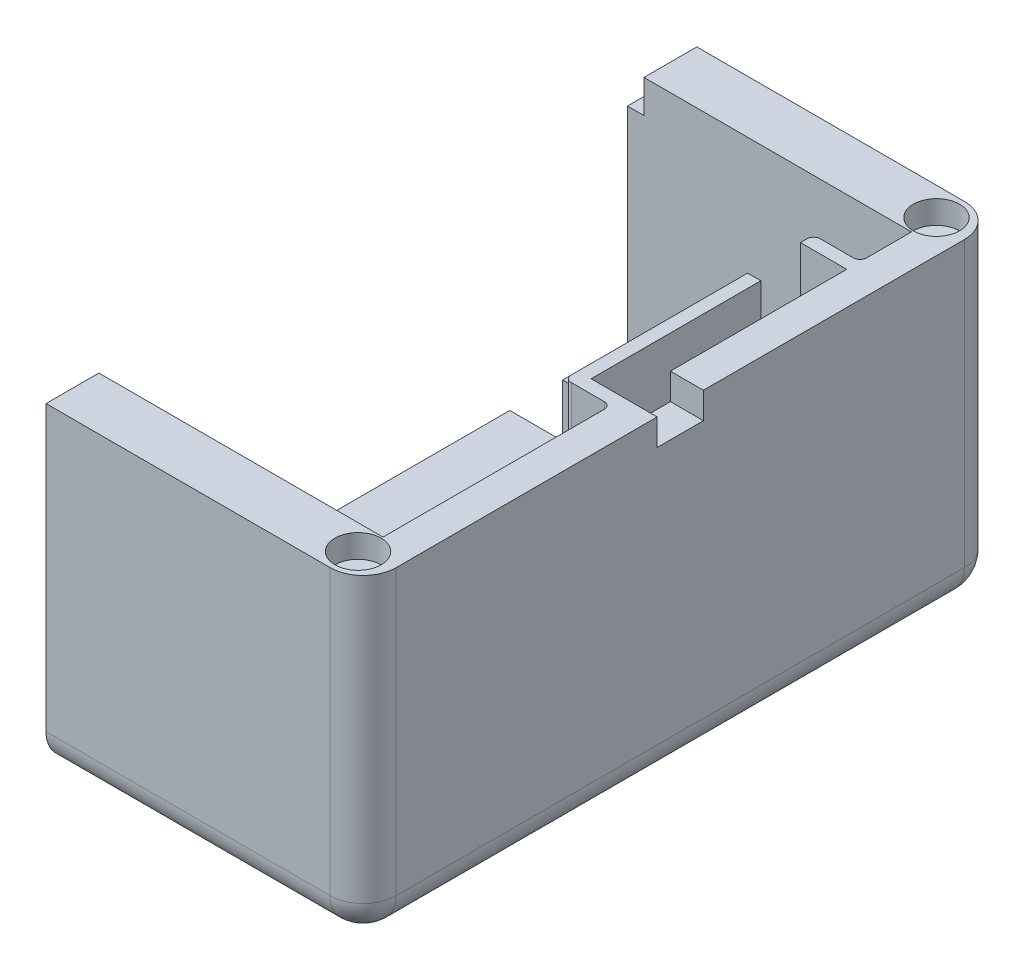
ISO-10303-21;
HEADER;
FILE_DESCRIPTION(('STEP AP214'),'2;1');
FILE_NAME('part.step','',(''),(''),'','','');
FILE_SCHEMA(('AUTOMOTIVE_DESIGN { 1 0 10303 214 1 1 1 1 }'));
ENDSEC;
DATA;
#1=APPLICATION_CONTEXT('core data for automotive mechanical design processes');
#2=APPLICATION_PROTOCOL_DEFINITION('international standard','automotive_design',2000,#1);
#3=PRODUCT_CONTEXT('',#1,'mechanical');
#4=PRODUCT('Part','Part','',(#3));
#5=PRODUCT_RELATED_PRODUCT_CATEGORY('part','',(#4));
#6=PRODUCT_DEFINITION_FORMATION('','',#4);
#7=PRODUCT_DEFINITION_CONTEXT('part definition',#1,'design');
#8=PRODUCT_DEFINITION('design','',#6,#7);
#9=PRODUCT_DEFINITION_SHAPE('','',#8);
#10=(LENGTH_UNIT() NAMED_UNIT(*) SI_UNIT(.MILLI.,.METRE.));
#11=(NAMED_UNIT(*) PLANE_ANGLE_UNIT() SI_UNIT($,.RADIAN.));
#12=(NAMED_UNIT(*) SI_UNIT($,.STERADIAN.) SOLID_ANGLE_UNIT());
#13=UNCERTAINTY_MEASURE_WITH_UNIT(LENGTH_MEASURE(1.E-05),#10,'distance_accuracy_value','');
#14=(GEOMETRIC_REPRESENTATION_CONTEXT(3) GLOBAL_UNCERTAINTY_ASSIGNED_CONTEXT((#13)) GLOBAL_UNIT_ASSIGNED_CONTEXT((#10,
#11,#12)) REPRESENTATION_CONTEXT('',''));
#15=CARTESIAN_POINT('',(0.,0.,0.));
#16=DIRECTION('',(0.,0.,1.));
#17=DIRECTION('',(1.,0.,0.));
#18=AXIS2_PLACEMENT_3D('',#15,#16,#17);
#19=CARTESIAN_POINT('',(-22.5530221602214,-8.75,8.));
#20=DIRECTION('',(1.,0.,0.));
#21=DIRECTION('',(0.,0.,-1.));
#22=AXIS2_PLACEMENT_3D('',#19,#20,#21);
#23=PLANE('',#22);
#24=CARTESIAN_POINT('',(-22.5530221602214,-3.75000000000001,4.22978260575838));
#25=DIRECTION('',(-1.,0.,0.));
#26=DIRECTION('',(0.,0.,-1.));
#27=AXIS2_PLACEMENT_3D('',#24,#25,#26);
#28=CIRCLE('',#27,3.5);
#29=CARTESIAN_POINT('',(-22.5530221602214,-3.75000000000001,0.729782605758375));
#30=VERTEX_POINT('',#29);
#31=EDGE_CURVE('E879',#30,#30,#28,.T.);
#32=ORIENTED_EDGE('',*,*,#31,.F.);
#33=EDGE_LOOP('',(#32));
#34=FACE_BOUND('',#33,.T.);
#35=DIRECTION('',(0.,0.,-1.));
#36=VECTOR('',#35,1.);
#37=CARTESIAN_POINT('',(-22.5530221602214,3.24999999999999,0.));
#38=LINE('',#37,#36);
#39=CARTESIAN_POINT('',(-22.5530221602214,3.24999999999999,17.8062937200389));
#40=VERTEX_POINT('',#39);
#41=CARTESIAN_POINT('',(-22.5530221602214,3.24999999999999,16.8062937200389));
#42=VERTEX_POINT('',#41);
#43=EDGE_CURVE('E846',#40,#42,#38,.T.);
#44=ORIENTED_EDGE('',*,*,#43,.T.);
#45=CARTESIAN_POINT('',(-22.5530221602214,2.25,16.8062937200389));
#46=DIRECTION('',(1.,0.,0.));
#47=DIRECTION('',(0.,0.,-1.));
#48=AXIS2_PLACEMENT_3D('',#45,#46,#47);
#49=CIRCLE('',#48,1.);
#50=CARTESIAN_POINT('',(-22.5530221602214,2.25,15.8062937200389));
#51=VERTEX_POINT('',#50);
#52=EDGE_CURVE('E495',#42,#51,#49,.F.);
#53=ORIENTED_EDGE('',*,*,#52,.T.);
#54=DIRECTION('',(0.,-1.,0.));
#55=VECTOR('',#54,1.);
#56=CARTESIAN_POINT('',(-22.5530221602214,3.24999999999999,15.8062937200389));
#57=LINE('',#56,#55);
#58=CARTESIAN_POINT('',(-22.5530221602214,-2.75,15.8062937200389));
#59=VERTEX_POINT('',#58);
#60=EDGE_CURVE('E812',#51,#59,#57,.T.);
#61=ORIENTED_EDGE('',*,*,#60,.T.);
#62=CARTESIAN_POINT('',(-22.5530221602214,-2.75,14.8062937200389));
#63=DIRECTION('',(1.,0.,0.));
#64=DIRECTION('',(0.,0.,-1.));
#65=AXIS2_PLACEMENT_3D('',#62,#63,#64);
#66=CIRCLE('',#65,1.);
#67=CARTESIAN_POINT('',(-22.5530221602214,-3.75,14.8062937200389));
#68=VERTEX_POINT('',#67);
#69=EDGE_CURVE('E509',#59,#68,#66,.T.);
#70=ORIENTED_EDGE('',*,*,#69,.T.);
#71=DIRECTION('',(0.,0.,-1.));
#72=VECTOR('',#71,1.);
#73=CARTESIAN_POINT('',(-22.5530221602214,-3.75,88.));
#74=LINE('',#73,#72);
#75=CARTESIAN_POINT('',(-22.5530221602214,-3.75,8.));
#76=VERTEX_POINT('',#75);
#77=EDGE_CURVE('E659',#68,#76,#74,.T.);
#78=ORIENTED_EDGE('',*,*,#77,.T.);
#79=DIRECTION('',(0.,-1.,0.));
#80=VECTOR('',#79,1.);
#81=CARTESIAN_POINT('',(-22.5530221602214,-8.75,8.));
#82=LINE('',#81,#80);
#83=CARTESIAN_POINT('',(-22.5530221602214,34.25,8.));
#84=VERTEX_POINT('',#83);
#85=EDGE_CURVE('E380',#84,#76,#82,.T.);
#86=ORIENTED_EDGE('',*,*,#85,.F.);
#87=DIRECTION('',(0.,0.,-1.));
#88=VECTOR('',#87,1.);
#89=CARTESIAN_POINT('',(-22.5530221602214,34.25,10.));
#90=LINE('',#89,#88);
#91=CARTESIAN_POINT('',(-22.5530221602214,34.25,0.));
#92=VERTEX_POINT('',#91);
#93=EDGE_CURVE('E364',#84,#92,#90,.T.);
#94=ORIENTED_EDGE('',*,*,#93,.T.);
#95=DIRECTION('',(0.,-1.,0.));
#96=VECTOR('',#95,1.);
#97=CARTESIAN_POINT('',(-22.5530221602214,-8.75,0.));
#98=LINE('',#97,#96);
#99=CARTESIAN_POINT('',(-22.5530221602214,-3.75,0.));
#100=VERTEX_POINT('',#99);
#101=EDGE_CURVE('E377',#92,#100,#98,.T.);
#102=ORIENTED_EDGE('',*,*,#101,.T.);
#103=CARTESIAN_POINT('',(-22.5530221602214,-3.75,5.));
#104=DIRECTION('',(1.,0.,0.));
#105=DIRECTION('',(0.,0.,-1.));
#106=AXIS2_PLACEMENT_3D('',#103,#104,#105);
#107=CIRCLE('',#106,5.);
#108=CARTESIAN_POINT('',(-22.5530221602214,-8.75,5.));
#109=VERTEX_POINT('',#108);
#110=EDGE_CURVE('E419',#100,#109,#107,.F.);
#111=ORIENTED_EDGE('',*,*,#110,.T.);
#112=DIRECTION('',(0.,0.,-1.));
#113=VECTOR('',#112,1.);
#114=CARTESIAN_POINT('',(-22.5530221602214,-8.75,8.));
#115=LINE('',#114,#113);
#116=CARTESIAN_POINT('',(-22.5530221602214,-8.75000000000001,44.5));
#117=VERTEX_POINT('',#116);
#118=EDGE_CURVE('E403',#117,#109,#115,.T.);
#119=ORIENTED_EDGE('',*,*,#118,.F.);
#120=DIRECTION('',(0.,-1.,0.));
#121=VECTOR('',#120,1.);
#122=CARTESIAN_POINT('',(-22.5530221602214,1.24999999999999,44.5));
#123=LINE('',#122,#121);
#124=CARTESIAN_POINT('',(-22.5530221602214,-3.75,44.5));
#125=VERTEX_POINT('',#124);
#126=EDGE_CURVE('E696',#125,#117,#123,.T.);
#127=ORIENTED_EDGE('',*,*,#126,.F.);
#128=CARTESIAN_POINT('',(-22.5530221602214,-3.75000000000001,17.8062937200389));
#129=VERTEX_POINT('',#128);
#130=EDGE_CURVE('E668',#125,#129,#74,.T.);
#131=ORIENTED_EDGE('',*,*,#130,.T.);
#132=DIRECTION('',(0.,-1.,0.));
#133=VECTOR('',#132,1.);
#134=CARTESIAN_POINT('',(-22.5530221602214,3.24999999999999,17.8062937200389));
#135=LINE('',#134,#133);
#136=EDGE_CURVE('E709',#40,#129,#135,.T.);
#137=ORIENTED_EDGE('',*,*,#136,.F.);
#138=EDGE_LOOP('',(#44,#53,#61,#70,#78,#86,#94,#102,#111,#119,#127,#131,#137));
#139=FACE_BOUND('',#138,.T.);
#140=ADVANCED_FACE('F37',(#34,#139),#23,.F.);
#141=CARTESIAN_POINT('',(16.6969778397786,3.25000000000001,0.));
#142=DIRECTION('',(0.,1.,0.));
#143=DIRECTION('',(0.,0.,1.));
#144=AXIS2_PLACEMENT_3D('',#141,#142,#143);
#145=PLANE('',#144);
#146=DIRECTION('',(0.,0.,-1.));
#147=VECTOR('',#146,1.);
#148=CARTESIAN_POINT('',(-12.5530221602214,3.25,15.8062937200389));
#149=LINE('',#148,#147);
#150=CARTESIAN_POINT('',(-12.5530221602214,3.25,52.5));
#151=VERTEX_POINT('',#150);
#152=CARTESIAN_POINT('',(-12.5530221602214,3.25,16.8062937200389));
#153=VERTEX_POINT('',#152);
#154=EDGE_CURVE('E491',#151,#153,#149,.T.);
#155=ORIENTED_EDGE('',*,*,#154,.T.);
#156=DIRECTION('',(1.,0.,0.));
#157=VECTOR('',#156,1.);
#158=CARTESIAN_POINT('',(16.6969778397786,3.25000000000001,16.8062937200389));
#159=LINE('',#158,#157);
#160=EDGE_CURVE('E493',#153,#42,#159,.F.);
#161=ORIENTED_EDGE('',*,*,#160,.T.);
#162=ORIENTED_EDGE('',*,*,#43,.F.);
#163=DIRECTION('',(1.,0.,0.));
#164=VECTOR('',#163,1.);
#165=CARTESIAN_POINT('',(16.6969778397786,3.25000000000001,17.8062937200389));
#166=LINE('',#165,#164);
#167=CARTESIAN_POINT('',(-13.5530221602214,3.25,17.8062937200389));
#168=VERTEX_POINT('',#167);
#169=EDGE_CURVE('E859',#40,#168,#166,.T.);
#170=ORIENTED_EDGE('',*,*,#169,.T.);
#171=DIRECTION('',(0.,0.,-1.));
#172=VECTOR('',#171,1.);
#173=CARTESIAN_POINT('',(-13.5530221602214,3.25,0.));
#174=LINE('',#173,#172);
#175=CARTESIAN_POINT('',(-13.5530221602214,3.25,25.8062937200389));
#176=VERTEX_POINT('',#175);
#177=EDGE_CURVE('E832',#176,#168,#174,.T.);
#178=ORIENTED_EDGE('',*,*,#177,.F.);
#179=DIRECTION('',(1.,0.,0.));
#180=VECTOR('',#179,1.);
#181=CARTESIAN_POINT('',(16.6969778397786,3.25000000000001,25.8062937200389));
#182=LINE('',#181,#180);
#183=CARTESIAN_POINT('',(-22.5530221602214,3.24999999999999,25.8062937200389));
#184=VERTEX_POINT('',#183);
#185=EDGE_CURVE('E863',#184,#176,#182,.T.);
#186=ORIENTED_EDGE('',*,*,#185,.F.);
#187=CARTESIAN_POINT('',(-22.5530221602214,3.24999999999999,52.5));
#188=VERTEX_POINT('',#187);
#189=EDGE_CURVE('E817',#188,#184,#38,.T.);
#190=ORIENTED_EDGE('',*,*,#189,.F.);
#191=DIRECTION('',(-1.,0.,0.));
#192=VECTOR('',#191,1.);
#193=CARTESIAN_POINT('',(16.6969778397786,3.25000000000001,52.5));
#194=LINE('',#193,#192);
#195=EDGE_CURVE('E489',#188,#151,#194,.F.);
#196=ORIENTED_EDGE('',*,*,#195,.T.);
#197=EDGE_LOOP('',(#155,#161,#162,#170,#178,#186,#190,#196));
#198=FACE_BOUND('',#197,.T.);
#199=ADVANCED_FACE('F930',(#198),#145,.T.);
#200=CARTESIAN_POINT('',(-22.5530221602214,-3.75,88.));
#201=DIRECTION('',(0.,-1.,0.));
#202=DIRECTION('',(0.,0.,-1.));
#203=AXIS2_PLACEMENT_3D('',#200,#201,#202);
#204=PLANE('',#203);
#205=DIRECTION('',(1.,0.,0.));
#206=VECTOR('',#205,1.);
#207=CARTESIAN_POINT('',(16.6969778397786,-3.74999999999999,17.8062937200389));
#208=LINE('',#207,#206);
#209=CARTESIAN_POINT('',(-13.5530221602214,-3.75,17.8062937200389));
#210=VERTEX_POINT('',#209);
#211=EDGE_CURVE('E837',#129,#210,#208,.T.);
#212=ORIENTED_EDGE('',*,*,#211,.F.);
#213=ORIENTED_EDGE('',*,*,#130,.F.);
#214=DIRECTION('',(-1.,0.,0.));
#215=VECTOR('',#214,1.);
#216=CARTESIAN_POINT('',(-22.5530221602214,-3.75,44.5));
#217=LINE('',#216,#215);
#218=CARTESIAN_POINT('',(-18.5530221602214,-3.75,44.5));
#219=VERTEX_POINT('',#218);
#220=EDGE_CURVE('E466',#219,#125,#217,.T.);
#221=ORIENTED_EDGE('',*,*,#220,.F.);
#222=DIRECTION('',(0.,0.,-1.));
#223=VECTOR('',#222,1.);
#224=CARTESIAN_POINT('',(-18.5530221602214,-3.75,88.));
#225=LINE('',#224,#223);
#226=CARTESIAN_POINT('',(-18.5530221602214,-3.75,51.5));
#227=VERTEX_POINT('',#226);
#228=EDGE_CURVE('E464',#227,#219,#225,.T.);
#229=ORIENTED_EDGE('',*,*,#228,.F.);
#230=DIRECTION('',(1.,0.,0.));
#231=VECTOR('',#230,1.);
#232=CARTESIAN_POINT('',(16.6969778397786,-3.74999999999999,51.5));
#233=LINE('',#232,#231);
#234=CARTESIAN_POINT('',(-13.5530221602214,-3.75,51.5));
#235=VERTEX_POINT('',#234);
#236=EDGE_CURVE('E844',#227,#235,#233,.T.);
#237=ORIENTED_EDGE('',*,*,#236,.T.);
#238=DIRECTION('',(0.,0.,-1.));
#239=VECTOR('',#238,1.);
#240=CARTESIAN_POINT('',(-13.5530221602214,-3.75,0.));
#241=LINE('',#240,#239);
#242=EDGE_CURVE('E829',#235,#210,#241,.T.);
#243=ORIENTED_EDGE('',*,*,#242,.T.);
#244=EDGE_LOOP('',(#212,#213,#221,#229,#237,#243));
#245=FACE_BOUND('',#244,.T.);
#246=ADVANCED_FACE('F842',(#245),#204,.F.);
#247=CARTESIAN_POINT('',(-22.5530221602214,-3.75000000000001,91.7702173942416));
#248=DIRECTION('',(1.,0.,0.));
#249=DIRECTION('',(0.,0.,1.));
#250=AXIS2_PLACEMENT_3D('',#247,#248,#249);
#251=CIRCLE('',#250,3.5);
#252=CARTESIAN_POINT('',(-22.5530221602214,-3.75000000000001,95.2702173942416));
#253=VERTEX_POINT('',#252);
#254=EDGE_CURVE('E873',#253,#253,#251,.T.);
#255=ORIENTED_EDGE('',*,*,#254,.T.);
#256=EDGE_LOOP('',(#255));
#257=FACE_BOUND('',#256,.T.);
#258=DIRECTION('',(0.,-1.,0.));
#259=VECTOR('',#258,1.);
#260=CARTESIAN_POINT('',(-22.5530221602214,3.24999999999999,53.5));
#261=LINE('',#260,#259);
#262=CARTESIAN_POINT('',(-22.5530221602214,2.25,53.5));
#263=VERTEX_POINT('',#262);
#264=CARTESIAN_POINT('',(-22.5530221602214,-2.75,53.5));
#265=VERTEX_POINT('',#264);
#266=EDGE_CURVE('E807',#263,#265,#261,.T.);
#267=ORIENTED_EDGE('',*,*,#266,.F.);
#268=CARTESIAN_POINT('',(-22.5530221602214,2.25,52.5));
#269=DIRECTION('',(1.,0.,0.));
#270=DIRECTION('',(0.,0.,-1.));
#271=AXIS2_PLACEMENT_3D('',#268,#269,#270);
#272=CIRCLE('',#271,1.);
#273=EDGE_CURVE('E507',#263,#188,#272,.F.);
#274=ORIENTED_EDGE('',*,*,#273,.T.);
#275=ORIENTED_EDGE('',*,*,#189,.T.);
#276=DIRECTION('',(0.,1.,0.));
#277=VECTOR('',#276,1.);
#278=CARTESIAN_POINT('',(-22.5530221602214,-1.75000000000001,25.8062937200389));
#279=LINE('',#278,#277);
#280=CARTESIAN_POINT('',(-22.5530221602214,1.24999999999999,25.8062937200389));
#281=VERTEX_POINT('',#280);
#282=EDGE_CURVE('E856',#281,#184,#279,.T.);
#283=ORIENTED_EDGE('',*,*,#282,.F.);
#284=DIRECTION('',(0.,0.,-1.));
#285=VECTOR('',#284,1.);
#286=CARTESIAN_POINT('',(-22.5530221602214,1.24999999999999,51.5));
#287=LINE('',#286,#285);
#288=CARTESIAN_POINT('',(-22.5530221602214,1.24999999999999,51.5));
#289=VERTEX_POINT('',#288);
#290=EDGE_CURVE('E850',#289,#281,#287,.T.);
#291=ORIENTED_EDGE('',*,*,#290,.F.);
#292=DIRECTION('',(0.,-1.,0.));
#293=VECTOR('',#292,1.);
#294=CARTESIAN_POINT('',(-22.5530221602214,1.24999999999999,51.5));
#295=LINE('',#294,#293);
#296=CARTESIAN_POINT('',(-22.5530221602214,-8.75000000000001,51.5));
#297=VERTEX_POINT('',#296);
#298=EDGE_CURVE('E721',#289,#297,#295,.T.);
#299=ORIENTED_EDGE('',*,*,#298,.T.);
#300=CARTESIAN_POINT('',(-22.5530221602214,-8.75,91.));
#301=VERTEX_POINT('',#300);
#302=EDGE_CURVE('E405',#301,#297,#115,.T.);
#303=ORIENTED_EDGE('',*,*,#302,.F.);
#304=CARTESIAN_POINT('',(-22.5530221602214,-3.75,91.));
#305=DIRECTION('',(1.,0.,0.));
#306=DIRECTION('',(0.,0.,-1.));
#307=AXIS2_PLACEMENT_3D('',#304,#305,#306);
#308=CIRCLE('',#307,5.);
#309=CARTESIAN_POINT('',(-22.5530221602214,-3.75,96.));
#310=VERTEX_POINT('',#309);
#311=EDGE_CURVE('E421',#301,#310,#308,.F.);
#312=ORIENTED_EDGE('',*,*,#311,.T.);
#313=DIRECTION('',(0.,-1.,0.));
#314=VECTOR('',#313,1.);
#315=CARTESIAN_POINT('',(-22.5530221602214,-8.75,96.));
#316=LINE('',#315,#314);
#317=CARTESIAN_POINT('',(-22.5530221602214,39.25,96.));
#318=VERTEX_POINT('',#317);
#319=EDGE_CURVE('E639',#318,#310,#316,.T.);
#320=ORIENTED_EDGE('',*,*,#319,.F.);
#321=DIRECTION('',(0.,0.,-1.));
#322=VECTOR('',#321,1.);
#323=CARTESIAN_POINT('',(-22.5530221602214,39.25,96.));
#324=LINE('',#323,#322);
#325=CARTESIAN_POINT('',(-22.5530221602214,39.25,88.));
#326=VERTEX_POINT('',#325);
#327=EDGE_CURVE('E645',#318,#326,#324,.T.);
#328=ORIENTED_EDGE('',*,*,#327,.T.);
#329=DIRECTION('',(0.,-1.,0.));
#330=VECTOR('',#329,1.);
#331=CARTESIAN_POINT('',(-22.5530221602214,-8.75,88.));
#332=LINE('',#331,#330);
#333=CARTESIAN_POINT('',(-22.5530221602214,-3.75,88.));
#334=VERTEX_POINT('',#333);
#335=EDGE_CURVE('E456',#326,#334,#332,.T.);
#336=ORIENTED_EDGE('',*,*,#335,.T.);
#337=CARTESIAN_POINT('',(-22.5530221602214,-3.75,54.5));
#338=VERTEX_POINT('',#337);
#339=EDGE_CURVE('E664',#334,#338,#74,.T.);
#340=ORIENTED_EDGE('',*,*,#339,.T.);
#341=CARTESIAN_POINT('',(-22.5530221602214,-2.75,54.5));
#342=DIRECTION('',(1.,0.,0.));
#343=DIRECTION('',(0.,0.,-1.));
#344=AXIS2_PLACEMENT_3D('',#341,#342,#343);
#345=CIRCLE('',#344,1.);
#346=EDGE_CURVE('E511',#338,#265,#345,.T.);
#347=ORIENTED_EDGE('',*,*,#346,.T.);
#348=EDGE_LOOP('',(#267,#274,#275,#283,#291,#299,#303,#312,#320,#328,#336,#340,#347));
#349=FACE_BOUND('',#348,.T.);
#350=ADVANCED_FACE('F787',(#257,#349),#23,.F.);
#351=CARTESIAN_POINT('',(-22.5530221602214,-8.75,8.));
#352=DIRECTION('',(0.,1.,0.));
#353=DIRECTION('',(0.,0.,1.));
#354=AXIS2_PLACEMENT_3D('',#351,#352,#353);
#355=PLANE('',#354);
#356=DIRECTION('',(-1.,0.,0.));
#357=VECTOR('',#356,1.);
#358=CARTESIAN_POINT('',(-22.5530221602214,-8.75000000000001,44.5));
#359=LINE('',#358,#357);
#360=CARTESIAN_POINT('',(-18.5530221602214,-8.75000000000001,44.5));
#361=VERTEX_POINT('',#360);
#362=EDGE_CURVE('E703',#361,#117,#359,.T.);
#363=ORIENTED_EDGE('',*,*,#362,.T.);
#364=ORIENTED_EDGE('',*,*,#118,.T.);
#365=DIRECTION('',(1.,0.,0.));
#366=VECTOR('',#365,1.);
#367=CARTESIAN_POINT('',(25.4469778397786,-8.75,5.));
#368=LINE('',#367,#366);
#369=CARTESIAN_POINT('',(20.4469778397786,-8.75,5.));
#370=VERTEX_POINT('',#369);
#371=EDGE_CURVE('E415',#109,#370,#368,.T.);
#372=ORIENTED_EDGE('',*,*,#371,.T.);
#373=DIRECTION('',(0.,0.,-1.));
#374=VECTOR('',#373,1.);
#375=CARTESIAN_POINT('',(20.4469778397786,-8.75,8.));
#376=LINE('',#375,#374);
#377=CARTESIAN_POINT('',(20.4469778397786,-8.75,91.));
#378=VERTEX_POINT('',#377);
#379=EDGE_CURVE('E413',#370,#378,#376,.F.);
#380=ORIENTED_EDGE('',*,*,#379,.T.);
#381=DIRECTION('',(1.,0.,0.));
#382=VECTOR('',#381,1.);
#383=CARTESIAN_POINT('',(-22.5530221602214,-8.75,91.));
#384=LINE('',#383,#382);
#385=EDGE_CURVE('E417',#378,#301,#384,.F.);
#386=ORIENTED_EDGE('',*,*,#385,.T.);
#387=ORIENTED_EDGE('',*,*,#302,.T.);
#388=DIRECTION('',(1.,0.,0.));
#389=VECTOR('',#388,1.);
#390=CARTESIAN_POINT('',(-22.5530221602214,-8.75000000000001,51.5));
#391=LINE('',#390,#389);
#392=CARTESIAN_POINT('',(-18.5530221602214,-8.75000000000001,51.5));
#393=VERTEX_POINT('',#392);
#394=EDGE_CURVE('E711',#297,#393,#391,.T.);
#395=ORIENTED_EDGE('',*,*,#394,.T.);
#396=DIRECTION('',(0.,0.,-1.));
#397=VECTOR('',#396,1.);
#398=CARTESIAN_POINT('',(-18.5530221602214,-8.75000000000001,44.5));
#399=LINE('',#398,#397);
#400=EDGE_CURVE('E706',#393,#361,#399,.T.);
#401=ORIENTED_EDGE('',*,*,#400,.T.);
#402=EDGE_LOOP('',(#363,#364,#372,#380,#386,#387,#395,#401));
#403=FACE_BOUND('',#402,.T.);
#404=ADVANCED_FACE('F700',(#403),#355,.F.);
#405=ORIENTED_EDGE('',*,*,#77,.F.);
#406=DIRECTION('',(1.,0.,0.));
#407=VECTOR('',#406,1.);
#408=CARTESIAN_POINT('',(-22.5530221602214,-3.75,14.8062937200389));
#409=LINE('',#408,#407);
#410=CARTESIAN_POINT('',(-12.5530221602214,-3.75,14.8062937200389));
#411=VERTEX_POINT('',#410);
#412=EDGE_CURVE('E480',#68,#411,#409,.T.);
#413=ORIENTED_EDGE('',*,*,#412,.T.);
#414=CARTESIAN_POINT('',(-12.5530221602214,-3.75,16.8062937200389));
#415=DIRECTION('',(0.,-1.,0.));
#416=DIRECTION('',(0.,0.,-1.));
#417=AXIS2_PLACEMENT_3D('',#414,#415,#416);
#418=CIRCLE('',#417,2.);
#419=CARTESIAN_POINT('',(-10.5530221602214,-3.75,16.8062937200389));
#420=VERTEX_POINT('',#419);
#421=EDGE_CURVE('E477',#420,#411,#418,.F.);
#422=ORIENTED_EDGE('',*,*,#421,.F.);
#423=DIRECTION('',(0.,0.,-1.));
#424=VECTOR('',#423,1.);
#425=CARTESIAN_POINT('',(-10.5530221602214,-3.75,53.5));
#426=LINE('',#425,#424);
#427=CARTESIAN_POINT('',(-10.5530221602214,-3.75,54.5));
#428=VERTEX_POINT('',#427);
#429=EDGE_CURVE('E475',#420,#428,#426,.F.);
#430=ORIENTED_EDGE('',*,*,#429,.T.);
#431=DIRECTION('',(-1.,0.,0.));
#432=VECTOR('',#431,1.);
#433=CARTESIAN_POINT('',(-22.5530221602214,-3.75,54.5));
#434=LINE('',#433,#432);
#435=EDGE_CURVE('E473',#428,#338,#434,.T.);
#436=ORIENTED_EDGE('',*,*,#435,.T.);
#437=ORIENTED_EDGE('',*,*,#339,.F.);
#438=DIRECTION('',(-1.,0.,0.));
#439=VECTOR('',#438,1.);
#440=CARTESIAN_POINT('',(-22.5530221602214,-3.75,88.));
#441=LINE('',#440,#439);
#442=CARTESIAN_POINT('',(20.4469778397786,-3.75,88.));
#443=VERTEX_POINT('',#442);
#444=EDGE_CURVE('E655',#443,#334,#441,.T.);
#445=ORIENTED_EDGE('',*,*,#444,.F.);
#446=DIRECTION('',(0.,0.,-1.));
#447=VECTOR('',#446,1.);
#448=CARTESIAN_POINT('',(20.4469778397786,-3.75,88.));
#449=LINE('',#448,#447);
#450=CARTESIAN_POINT('',(20.4469778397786,-3.75,8.));
#451=VERTEX_POINT('',#450);
#452=EDGE_CURVE('E667',#443,#451,#449,.T.);
#453=ORIENTED_EDGE('',*,*,#452,.T.);
#454=DIRECTION('',(-1.,0.,0.));
#455=VECTOR('',#454,1.);
#456=CARTESIAN_POINT('',(-22.5530221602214,-3.75,8.));
#457=LINE('',#456,#455);
#458=EDGE_CURVE('E656',#451,#76,#457,.T.);
#459=ORIENTED_EDGE('',*,*,#458,.T.);
#460=EDGE_LOOP('',(#405,#413,#422,#430,#436,#437,#445,#453,#459));
#461=FACE_BOUND('',#460,.T.);
#462=ADVANCED_FACE('F792',(#461),#204,.F.);
#463=CARTESIAN_POINT('',(-22.5530221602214,39.25,8.));
#464=DIRECTION('',(0.,-1.,0.));
#465=DIRECTION('',(0.,0.,-1.));
#466=AXIS2_PLACEMENT_3D('',#463,#464,#465);
#467=PLANE('',#466);
#468=CARTESIAN_POINT('',(20.4469778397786,39.25,91.7702173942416));
#469=DIRECTION('',(0.,1.,0.));
#470=DIRECTION('',(0.,0.,1.));
#471=AXIS2_PLACEMENT_3D('',#468,#469,#470);
#472=CIRCLE('',#471,3.5);
#473=CARTESIAN_POINT('',(20.4469778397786,39.25,95.2702173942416));
#474=VERTEX_POINT('',#473);
#475=EDGE_CURVE('E867',#474,#474,#472,.T.);
#476=ORIENTED_EDGE('',*,*,#475,.F.);
#477=EDGE_LOOP('',(#476));
#478=FACE_BOUND('',#477,.T.);
#479=DIRECTION('',(0.,0.,-1.));
#480=VECTOR('',#479,1.);
#481=CARTESIAN_POINT('',(13.4469778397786,39.25,0.));
#482=LINE('',#481,#480);
#483=CARTESIAN_POINT('',(13.4469778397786,39.25,52.5));
#484=VERTEX_POINT('',#483);
#485=CARTESIAN_POINT('',(13.4469778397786,39.25,25.8062937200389));
#486=VERTEX_POINT('',#485);
#487=EDGE_CURVE('E748',#484,#486,#482,.T.);
#488=ORIENTED_EDGE('',*,*,#487,.F.);
#489=CARTESIAN_POINT('',(14.4469778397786,39.25,52.5));
#490=DIRECTION('',(0.,-1.,0.));
#491=DIRECTION('',(0.,0.,-1.));
#492=AXIS2_PLACEMENT_3D('',#489,#490,#491);
#493=CIRCLE('',#492,1.);
#494=CARTESIAN_POINT('',(14.4469778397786,39.25,53.5));
#495=VERTEX_POINT('',#494);
#496=EDGE_CURVE('E565',#484,#495,#493,.F.);
#497=ORIENTED_EDGE('',*,*,#496,.T.);
#498=DIRECTION('',(1.,0.,0.));
#499=VECTOR('',#498,1.);
#500=CARTESIAN_POINT('',(13.4469778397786,39.25,53.5));
#501=LINE('',#500,#499);
#502=CARTESIAN_POINT('',(19.4469778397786,39.25,53.5));
#503=VERTEX_POINT('',#502);
#504=EDGE_CURVE('E622',#495,#503,#501,.T.);
#505=ORIENTED_EDGE('',*,*,#504,.T.);
#506=CARTESIAN_POINT('',(19.4469778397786,39.25,54.5));
#507=DIRECTION('',(0.,-1.,0.));
#508=DIRECTION('',(0.,0.,-1.));
#509=AXIS2_PLACEMENT_3D('',#506,#507,#508);
#510=CIRCLE('',#509,1.);
#511=CARTESIAN_POINT('',(20.4469778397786,39.25,54.5));
#512=VERTEX_POINT('',#511);
#513=EDGE_CURVE('E11',#503,#512,#510,.T.);
#514=ORIENTED_EDGE('',*,*,#513,.T.);
#515=DIRECTION('',(0.,0.,-1.));
#516=VECTOR('',#515,1.);
#517=CARTESIAN_POINT('',(20.4469778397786,39.25,88.));
#518=LINE('',#517,#516);
#519=CARTESIAN_POINT('',(20.4469778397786,39.25,88.));
#520=VERTEX_POINT('',#519);
#521=EDGE_CURVE('E388',#520,#512,#518,.T.);
#522=ORIENTED_EDGE('',*,*,#521,.F.);
#523=DIRECTION('',(-1.,0.,0.));
#524=VECTOR('',#523,1.);
#525=CARTESIAN_POINT('',(-22.5530221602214,39.25,88.));
#526=LINE('',#525,#524);
#527=EDGE_CURVE('E643',#520,#326,#526,.T.);
#528=ORIENTED_EDGE('',*,*,#527,.T.);
#529=ORIENTED_EDGE('',*,*,#327,.F.);
#530=DIRECTION('',(-1.,0.,0.));
#531=VECTOR('',#530,1.);
#532=CARTESIAN_POINT('',(-22.5530221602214,39.25,96.));
#533=LINE('',#532,#531);
#534=CARTESIAN_POINT('',(20.4469778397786,39.25,96.));
#535=VERTEX_POINT('',#534);
#536=EDGE_CURVE('E642',#535,#318,#533,.T.);
#537=ORIENTED_EDGE('',*,*,#536,.F.);
#538=CARTESIAN_POINT('',(20.4469778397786,39.25,91.));
#539=DIRECTION('',(0.,-1.,0.));
#540=DIRECTION('',(0.,0.,-1.));
#541=AXIS2_PLACEMENT_3D('',#538,#539,#540);
#542=CIRCLE('',#541,5.);
#543=CARTESIAN_POINT('',(25.4469778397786,39.25,91.));
#544=VERTEX_POINT('',#543);
#545=EDGE_CURVE('E425',#535,#544,#542,.F.);
#546=ORIENTED_EDGE('',*,*,#545,.T.);
#547=DIRECTION('',(0.,0.,-1.));
#548=VECTOR('',#547,1.);
#549=CARTESIAN_POINT('',(25.4469778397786,39.25,8.));
#550=LINE('',#549,#548);
#551=CARTESIAN_POINT('',(25.4469778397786,39.25,51.5));
#552=VERTEX_POINT('',#551);
#553=EDGE_CURVE('E400',#544,#552,#550,.T.);
#554=ORIENTED_EDGE('',*,*,#553,.T.);
#555=DIRECTION('',(1.,0.,0.));
#556=VECTOR('',#555,1.);
#557=CARTESIAN_POINT('',(15.4469778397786,39.25,51.5));
#558=LINE('',#557,#556);
#559=CARTESIAN_POINT('',(15.4469778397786,39.25,51.5));
#560=VERTEX_POINT('',#559);
#561=EDGE_CURVE('E635',#560,#552,#558,.T.);
#562=ORIENTED_EDGE('',*,*,#561,.F.);
#563=DIRECTION('',(0.,0.,-1.));
#564=VECTOR('',#563,1.);
#565=CARTESIAN_POINT('',(15.4469778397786,39.25,51.5));
#566=LINE('',#565,#564);
#567=CARTESIAN_POINT('',(15.4469778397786,39.25,25.8062937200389));
#568=VERTEX_POINT('',#567);
#569=EDGE_CURVE('E740',#560,#568,#566,.T.);
#570=ORIENTED_EDGE('',*,*,#569,.T.);
#571=DIRECTION('',(-1.,0.,0.));
#572=VECTOR('',#571,1.);
#573=CARTESIAN_POINT('',(18.4469778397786,39.25,25.8062937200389));
#574=LINE('',#573,#572);
#575=EDGE_CURVE('E735',#568,#486,#574,.T.);
#576=ORIENTED_EDGE('',*,*,#575,.T.);
#577=EDGE_LOOP('',(#488,#497,#505,#514,#522,#528,#529,#537,#546,#554,#562,#570,#576));
#578=FACE_BOUND('',#577,.T.);
#579=ADVANCED_FACE('F768',(#478,#578),#467,.F.);
#580=CARTESIAN_POINT('',(13.4469778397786,0.,0.));
#581=DIRECTION('',(-1.,0.,0.));
#582=DIRECTION('',(0.,0.,1.));
#583=AXIS2_PLACEMENT_3D('',#580,#581,#582);
#584=PLANE('',#583);
#585=CARTESIAN_POINT('',(13.4469778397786,39.25,17.8062937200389));
#586=VERTEX_POINT('',#585);
#587=CARTESIAN_POINT('',(13.4469778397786,39.25,16.8062937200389));
#588=VERTEX_POINT('',#587);
#589=EDGE_CURVE('E751',#586,#588,#482,.T.);
#590=ORIENTED_EDGE('',*,*,#589,.T.);
#591=DIRECTION('',(0.,-1.,0.));
#592=VECTOR('',#591,1.);
#593=CARTESIAN_POINT('',(13.4469778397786,28.25,16.8062937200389));
#594=LINE('',#593,#592);
#595=CARTESIAN_POINT('',(13.4469778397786,29.25,16.8062937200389));
#596=VERTEX_POINT('',#595);
#597=EDGE_CURVE('E555',#588,#596,#594,.T.);
#598=ORIENTED_EDGE('',*,*,#597,.T.);
#599=DIRECTION('',(0.,0.,-1.));
#600=VECTOR('',#599,1.);
#601=CARTESIAN_POINT('',(13.4469778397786,29.25,0.));
#602=LINE('',#601,#600);
#603=CARTESIAN_POINT('',(13.4469778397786,29.25,52.5));
#604=VERTEX_POINT('',#603);
#605=EDGE_CURVE('E553',#596,#604,#602,.F.);
#606=ORIENTED_EDGE('',*,*,#605,.T.);
#607=DIRECTION('',(0.,1.,0.));
#608=VECTOR('',#607,1.);
#609=CARTESIAN_POINT('',(13.4469778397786,39.25,52.5));
#610=LINE('',#609,#608);
#611=EDGE_CURVE('E551',#604,#484,#610,.T.);
#612=ORIENTED_EDGE('',*,*,#611,.T.);
#613=ORIENTED_EDGE('',*,*,#487,.T.);
#614=DIRECTION('',(0.,-1.,0.));
#615=VECTOR('',#614,1.);
#616=CARTESIAN_POINT('',(13.4469778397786,0.,25.8062937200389));
#617=LINE('',#616,#615);
#618=CARTESIAN_POINT('',(13.4469778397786,30.25,25.8062937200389));
#619=VERTEX_POINT('',#618);
#620=EDGE_CURVE('E731',#486,#619,#617,.T.);
#621=ORIENTED_EDGE('',*,*,#620,.T.);
#622=DIRECTION('',(0.,0.,-1.));
#623=VECTOR('',#622,1.);
#624=CARTESIAN_POINT('',(13.4469778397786,30.25,0.));
#625=LINE('',#624,#623);
#626=CARTESIAN_POINT('',(13.4469778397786,30.25,17.8062937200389));
#627=VERTEX_POINT('',#626);
#628=EDGE_CURVE('E728',#619,#627,#625,.T.);
#629=ORIENTED_EDGE('',*,*,#628,.T.);
#630=DIRECTION('',(0.,-1.,0.));
#631=VECTOR('',#630,1.);
#632=CARTESIAN_POINT('',(13.4469778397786,0.,17.8062937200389));
#633=LINE('',#632,#631);
#634=EDGE_CURVE('E720',#586,#627,#633,.T.);
#635=ORIENTED_EDGE('',*,*,#634,.F.);
#636=EDGE_LOOP('',(#590,#598,#606,#612,#613,#621,#629,#635));
#637=FACE_BOUND('',#636,.T.);
#638=ADVANCED_FACE('F1011',(#637),#584,.T.);
#639=CARTESIAN_POINT('',(15.4469778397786,39.25,51.5));
#640=DIRECTION('',(-1.,0.,0.));
#641=DIRECTION('',(0.,0.,1.));
#642=AXIS2_PLACEMENT_3D('',#639,#640,#641);
#643=PLANE('',#642);
#644=DIRECTION('',(0.,-1.,0.));
#645=VECTOR('',#644,1.);
#646=CARTESIAN_POINT('',(15.4469778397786,39.25,25.8062937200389));
#647=LINE('',#646,#645);
#648=CARTESIAN_POINT('',(15.4469778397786,30.25,25.8062937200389));
#649=VERTEX_POINT('',#648);
#650=EDGE_CURVE('E462',#568,#649,#647,.T.);
#651=ORIENTED_EDGE('',*,*,#650,.F.);
#652=ORIENTED_EDGE('',*,*,#569,.F.);
#653=DIRECTION('',(0.,-1.,0.));
#654=VECTOR('',#653,1.);
#655=CARTESIAN_POINT('',(15.4469778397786,39.25,51.5));
#656=LINE('',#655,#654);
#657=CARTESIAN_POINT('',(15.4469778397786,30.25,51.5));
#658=VERTEX_POINT('',#657);
#659=EDGE_CURVE('E743',#560,#658,#656,.T.);
#660=ORIENTED_EDGE('',*,*,#659,.T.);
#661=DIRECTION('',(0.,0.,-1.));
#662=VECTOR('',#661,1.);
#663=CARTESIAN_POINT('',(15.4469778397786,30.25,51.5));
#664=LINE('',#663,#662);
#665=EDGE_CURVE('E738',#658,#649,#664,.T.);
#666=ORIENTED_EDGE('',*,*,#665,.T.);
#667=EDGE_LOOP('',(#651,#652,#660,#666));
#668=FACE_BOUND('',#667,.T.);
#669=ADVANCED_FACE('F1007',(#668),#643,.F.);
#670=CARTESIAN_POINT('',(15.4469778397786,39.25,51.5));
#671=DIRECTION('',(0.,0.,1.));
#672=DIRECTION('',(1.,0.,0.));
#673=AXIS2_PLACEMENT_3D('',#670,#671,#672);
#674=PLANE('',#673);
#675=ORIENTED_EDGE('',*,*,#659,.F.);
#676=ORIENTED_EDGE('',*,*,#561,.T.);
#677=DIRECTION('',(0.,-1.,0.));
#678=VECTOR('',#677,1.);
#679=CARTESIAN_POINT('',(25.4469778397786,39.25,51.5));
#680=LINE('',#679,#678);
#681=CARTESIAN_POINT('',(25.4469778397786,35.25,51.5));
#682=VERTEX_POINT('',#681);
#683=EDGE_CURVE('E620',#552,#682,#680,.T.);
#684=ORIENTED_EDGE('',*,*,#683,.T.);
#685=DIRECTION('',(1.,0.,0.));
#686=VECTOR('',#685,1.);
#687=CARTESIAN_POINT('',(15.4469778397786,35.25,51.5));
#688=LINE('',#687,#686);
#689=CARTESIAN_POINT('',(20.4469778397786,35.25,51.5));
#690=VERTEX_POINT('',#689);
#691=EDGE_CURVE('E633',#690,#682,#688,.T.);
#692=ORIENTED_EDGE('',*,*,#691,.F.);
#693=DIRECTION('',(0.,-1.,0.));
#694=VECTOR('',#693,1.);
#695=CARTESIAN_POINT('',(20.4469778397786,0.,51.5));
#696=LINE('',#695,#694);
#697=CARTESIAN_POINT('',(20.4469778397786,30.25,51.5));
#698=VERTEX_POINT('',#697);
#699=EDGE_CURVE('E747',#690,#698,#696,.T.);
#700=ORIENTED_EDGE('',*,*,#699,.T.);
#701=DIRECTION('',(1.,0.,0.));
#702=VECTOR('',#701,1.);
#703=CARTESIAN_POINT('',(13.4469778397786,30.25,51.5));
#704=LINE('',#703,#702);
#705=EDGE_CURVE('E763',#658,#698,#704,.T.);
#706=ORIENTED_EDGE('',*,*,#705,.F.);
#707=EDGE_LOOP('',(#675,#676,#684,#692,#700,#706));
#708=FACE_BOUND('',#707,.T.);
#709=ADVANCED_FACE('F1010',(#708),#674,.F.);
#710=CARTESIAN_POINT('',(13.4469778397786,30.25,0.));
#711=DIRECTION('',(0.,-1.,0.));
#712=DIRECTION('',(0.,0.,-1.));
#713=AXIS2_PLACEMENT_3D('',#710,#711,#712);
#714=PLANE('',#713);
#715=DIRECTION('',(1.,0.,0.));
#716=VECTOR('',#715,1.);
#717=CARTESIAN_POINT('',(13.4469778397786,30.25,17.8062937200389));
#718=LINE('',#717,#716);
#719=CARTESIAN_POINT('',(20.4469778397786,30.25,17.8062937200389));
#720=VERTEX_POINT('',#719);
#721=EDGE_CURVE('E761',#627,#720,#718,.T.);
#722=ORIENTED_EDGE('',*,*,#721,.F.);
#723=ORIENTED_EDGE('',*,*,#628,.F.);
#724=DIRECTION('',(-1.,0.,0.));
#725=VECTOR('',#724,1.);
#726=CARTESIAN_POINT('',(18.4469778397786,30.25,25.8062937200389));
#727=LINE('',#726,#725);
#728=EDGE_CURVE('E734',#649,#619,#727,.T.);
#729=ORIENTED_EDGE('',*,*,#728,.F.);
#730=ORIENTED_EDGE('',*,*,#665,.F.);
#731=ORIENTED_EDGE('',*,*,#705,.T.);
#732=DIRECTION('',(0.,0.,-1.));
#733=VECTOR('',#732,1.);
#734=CARTESIAN_POINT('',(20.4469778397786,30.25,0.));
#735=LINE('',#734,#733);
#736=EDGE_CURVE('E754',#698,#720,#735,.T.);
#737=ORIENTED_EDGE('',*,*,#736,.T.);
#738=EDGE_LOOP('',(#722,#723,#729,#730,#731,#737));
#739=FACE_BOUND('',#738,.T.);
#740=ADVANCED_FACE('F1019',(#739),#714,.F.);
#741=CARTESIAN_POINT('',(13.4469778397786,0.,17.8062937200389));
#742=DIRECTION('',(0.,0.,1.));
#743=DIRECTION('',(1.,0.,0.));
#744=AXIS2_PLACEMENT_3D('',#741,#742,#743);
#745=PLANE('',#744);
#746=ORIENTED_EDGE('',*,*,#721,.T.);
#747=DIRECTION('',(0.,-1.,0.));
#748=VECTOR('',#747,1.);
#749=CARTESIAN_POINT('',(20.4469778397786,0.,17.8062937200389));
#750=LINE('',#749,#748);
#751=CARTESIAN_POINT('',(20.4469778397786,39.25,17.8062937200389));
#752=VERTEX_POINT('',#751);
#753=EDGE_CURVE('E757',#752,#720,#750,.T.);
#754=ORIENTED_EDGE('',*,*,#753,.F.);
#755=DIRECTION('',(1.,0.,0.));
#756=VECTOR('',#755,1.);
#757=CARTESIAN_POINT('',(13.4469778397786,39.25,17.8062937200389));
#758=LINE('',#757,#756);
#759=EDGE_CURVE('E750',#586,#752,#758,.T.);
#760=ORIENTED_EDGE('',*,*,#759,.F.);
#761=ORIENTED_EDGE('',*,*,#634,.T.);
#762=EDGE_LOOP('',(#746,#754,#760,#761));
#763=FACE_BOUND('',#762,.T.);
#764=ADVANCED_FACE('F1016',(#763),#745,.T.);
#765=CARTESIAN_POINT('',(20.4469778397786,-3.75,88.));
#766=DIRECTION('',(1.,0.,0.));
#767=DIRECTION('',(0.,0.,-1.));
#768=AXIS2_PLACEMENT_3D('',#765,#766,#767);
#769=PLANE('',#768);
#770=DIRECTION('',(0.,0.,-1.));
#771=VECTOR('',#770,1.);
#772=CARTESIAN_POINT('',(20.4469778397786,27.25,88.));
#773=LINE('',#772,#771);
#774=CARTESIAN_POINT('',(20.4469778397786,27.25,52.5));
#775=VERTEX_POINT('',#774);
#776=CARTESIAN_POINT('',(20.4469778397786,27.25,14.8062937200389));
#777=VERTEX_POINT('',#776);
#778=EDGE_CURVE('E547',#775,#777,#773,.T.);
#779=ORIENTED_EDGE('',*,*,#778,.T.);
#780=DIRECTION('',(0.,-1.,0.));
#781=VECTOR('',#780,1.);
#782=CARTESIAN_POINT('',(20.4469778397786,39.25,14.8062937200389));
#783=LINE('',#782,#781);
#784=CARTESIAN_POINT('',(20.4469778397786,39.25,14.8062937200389));
#785=VERTEX_POINT('',#784);
#786=EDGE_CURVE('E549',#777,#785,#783,.F.);
#787=ORIENTED_EDGE('',*,*,#786,.T.);
#788=CARTESIAN_POINT('',(20.4469778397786,39.25,8.));
#789=VERTEX_POINT('',#788);
#790=EDGE_CURVE('E395',#785,#789,#518,.T.);
#791=ORIENTED_EDGE('',*,*,#790,.T.);
#792=DIRECTION('',(0.,-1.,0.));
#793=VECTOR('',#792,1.);
#794=CARTESIAN_POINT('',(20.4469778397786,-3.75,8.));
#795=LINE('',#794,#793);
#796=EDGE_CURVE('E651',#789,#451,#795,.T.);
#797=ORIENTED_EDGE('',*,*,#796,.T.);
#798=ORIENTED_EDGE('',*,*,#452,.F.);
#799=DIRECTION('',(0.,-1.,0.));
#800=VECTOR('',#799,1.);
#801=CARTESIAN_POINT('',(20.4469778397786,-3.75,88.));
#802=LINE('',#801,#800);
#803=EDGE_CURVE('E652',#520,#443,#802,.T.);
#804=ORIENTED_EDGE('',*,*,#803,.F.);
#805=ORIENTED_EDGE('',*,*,#521,.T.);
#806=DIRECTION('',(0.,1.,0.));
#807=VECTOR('',#806,1.);
#808=CARTESIAN_POINT('',(20.4469778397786,28.25,54.5));
#809=LINE('',#808,#807);
#810=CARTESIAN_POINT('',(20.4469778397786,29.25,54.5));
#811=VERTEX_POINT('',#810);
#812=EDGE_CURVE('E545',#512,#811,#809,.F.);
#813=ORIENTED_EDGE('',*,*,#812,.T.);
#814=CARTESIAN_POINT('',(20.4469778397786,29.25,52.5));
#815=DIRECTION('',(1.,0.,0.));
#816=DIRECTION('',(0.,0.,-1.));
#817=AXIS2_PLACEMENT_3D('',#814,#815,#816);
#818=CIRCLE('',#817,2.);
#819=EDGE_CURVE('E542',#775,#811,#818,.F.);
#820=ORIENTED_EDGE('',*,*,#819,.F.);
#821=EDGE_LOOP('',(#779,#787,#791,#797,#798,#804,#805,#813,#820));
#822=FACE_BOUND('',#821,.T.);
#823=ADVANCED_FACE('F776',(#822),#769,.F.);
#824=ORIENTED_EDGE('',*,*,#699,.F.);
#825=DIRECTION('',(0.,0.,-1.));
#826=VECTOR('',#825,1.);
#827=CARTESIAN_POINT('',(20.4469778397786,35.25,88.));
#828=LINE('',#827,#826);
#829=CARTESIAN_POINT('',(20.4469778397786,35.25,44.5));
#830=VERTEX_POINT('',#829);
#831=EDGE_CURVE('E437',#690,#830,#828,.T.);
#832=ORIENTED_EDGE('',*,*,#831,.T.);
#833=DIRECTION('',(0.,1.,0.));
#834=VECTOR('',#833,1.);
#835=CARTESIAN_POINT('',(20.4469778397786,-3.75,44.5));
#836=LINE('',#835,#834);
#837=CARTESIAN_POINT('',(20.4469778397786,39.25,44.5));
#838=VERTEX_POINT('',#837);
#839=EDGE_CURVE('E459',#830,#838,#836,.T.);
#840=ORIENTED_EDGE('',*,*,#839,.T.);
#841=EDGE_CURVE('E393',#838,#752,#518,.T.);
#842=ORIENTED_EDGE('',*,*,#841,.T.);
#843=ORIENTED_EDGE('',*,*,#753,.T.);
#844=ORIENTED_EDGE('',*,*,#736,.F.);
#845=EDGE_LOOP('',(#824,#832,#840,#842,#843,#844));
#846=FACE_BOUND('',#845,.T.);
#847=ADVANCED_FACE('F1054',(#846),#769,.F.);
#848=CARTESIAN_POINT('',(0.,0.,8.));
#849=DIRECTION('',(0.,0.,-1.));
#850=DIRECTION('',(-1.,0.,0.));
#851=AXIS2_PLACEMENT_3D('',#848,#849,#850);
#852=PLANE('',#851);
#853=DIRECTION('',(-1.,0.,0.));
#854=VECTOR('',#853,1.);
#855=CARTESIAN_POINT('',(-22.5530221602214,39.25,8.));
#856=LINE('',#855,#854);
#857=CARTESIAN_POINT('',(-20.0530221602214,39.25,8.));
#858=VERTEX_POINT('',#857);
#859=EDGE_CURVE('E397',#789,#858,#856,.T.);
#860=ORIENTED_EDGE('',*,*,#859,.T.);
#861=DIRECTION('',(0.,-1.,0.));
#862=VECTOR('',#861,1.);
#863=CARTESIAN_POINT('',(-20.0530221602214,0.,8.));
#864=LINE('',#863,#862);
#865=CARTESIAN_POINT('',(-20.0530221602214,34.25,8.));
#866=VERTEX_POINT('',#865);
#867=EDGE_CURVE('E888',#858,#866,#864,.T.);
#868=ORIENTED_EDGE('',*,*,#867,.T.);
#869=DIRECTION('',(-1.,0.,0.));
#870=VECTOR('',#869,1.);
#871=CARTESIAN_POINT('',(0.,34.2499999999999,8.));
#872=LINE('',#871,#870);
#873=EDGE_CURVE('E892',#866,#84,#872,.T.);
#874=ORIENTED_EDGE('',*,*,#873,.T.);
#875=ORIENTED_EDGE('',*,*,#85,.T.);
#876=ORIENTED_EDGE('',*,*,#458,.F.);
#877=ORIENTED_EDGE('',*,*,#796,.F.);
#878=EDGE_LOOP('',(#860,#868,#874,#875,#876,#877));
#879=FACE_BOUND('',#878,.T.);
#880=ADVANCED_FACE('F1055',(#879),#852,.F.);
#881=CARTESIAN_POINT('',(25.4469778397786,-8.75,8.));
#882=DIRECTION('',(-1.,0.,0.));
#883=DIRECTION('',(0.,0.,1.));
#884=AXIS2_PLACEMENT_3D('',#881,#882,#883);
#885=PLANE('',#884);
#886=CARTESIAN_POINT('',(25.4469778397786,39.25,44.5));
#887=VERTEX_POINT('',#886);
#888=CARTESIAN_POINT('',(25.4469778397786,39.25,5.));
#889=VERTEX_POINT('',#888);
#890=EDGE_CURVE('E404',#887,#889,#550,.T.);
#891=ORIENTED_EDGE('',*,*,#890,.F.);
#892=DIRECTION('',(0.,1.,0.));
#893=VECTOR('',#892,1.);
#894=CARTESIAN_POINT('',(25.4469778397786,39.25,44.5));
#895=LINE('',#894,#893);
#896=CARTESIAN_POINT('',(25.4469778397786,35.25,44.5));
#897=VERTEX_POINT('',#896);
#898=EDGE_CURVE('E618',#897,#887,#895,.T.);
#899=ORIENTED_EDGE('',*,*,#898,.F.);
#900=DIRECTION('',(0.,0.,-1.));
#901=VECTOR('',#900,1.);
#902=CARTESIAN_POINT('',(25.4469778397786,35.25,44.5));
#903=LINE('',#902,#901);
#904=EDGE_CURVE('E628',#682,#897,#903,.T.);
#905=ORIENTED_EDGE('',*,*,#904,.F.);
#906=ORIENTED_EDGE('',*,*,#683,.F.);
#907=ORIENTED_EDGE('',*,*,#553,.F.);
#908=DIRECTION('',(0.,1.,0.));
#909=VECTOR('',#908,1.);
#910=CARTESIAN_POINT('',(25.4469778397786,-8.75,91.));
#911=LINE('',#910,#909);
#912=CARTESIAN_POINT('',(25.4469778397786,-3.75,91.));
#913=VERTEX_POINT('',#912);
#914=EDGE_CURVE('E432',#544,#913,#911,.F.);
#915=ORIENTED_EDGE('',*,*,#914,.T.);
#916=DIRECTION('',(0.,0.,-1.));
#917=VECTOR('',#916,1.);
#918=CARTESIAN_POINT('',(25.4469778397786,-3.75,8.));
#919=LINE('',#918,#917);
#920=CARTESIAN_POINT('',(25.4469778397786,-3.75,5.));
#921=VERTEX_POINT('',#920);
#922=EDGE_CURVE('E427',#913,#921,#919,.T.);
#923=ORIENTED_EDGE('',*,*,#922,.T.);
#924=DIRECTION('',(0.,1.,0.));
#925=VECTOR('',#924,1.);
#926=CARTESIAN_POINT('',(25.4469778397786,39.25,5.));
#927=LINE('',#926,#925);
#928=EDGE_CURVE('E429',#921,#889,#927,.T.);
#929=ORIENTED_EDGE('',*,*,#928,.T.);
#930=EDGE_LOOP('',(#891,#899,#905,#906,#907,#915,#923,#929));
#931=FACE_BOUND('',#930,.T.);
#932=ADVANCED_FACE('F682',(#931),#885,.F.);
#933=CARTESIAN_POINT('',(20.4469778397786,39.25,4.22978260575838));
#934=DIRECTION('',(0.,-1.,0.));
#935=DIRECTION('',(0.,0.,-1.));
#936=AXIS2_PLACEMENT_3D('',#933,#934,#935);
#937=CIRCLE('',#936,3.5);
#938=CARTESIAN_POINT('',(20.4469778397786,39.25,0.729782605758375));
#939=VERTEX_POINT('',#938);
#940=EDGE_CURVE('E885',#939,#939,#937,.T.);
#941=ORIENTED_EDGE('',*,*,#940,.T.);
#942=EDGE_LOOP('',(#941));
#943=FACE_BOUND('',#942,.T.);
#944=DIRECTION('',(1.,0.,0.));
#945=VECTOR('',#944,1.);
#946=CARTESIAN_POINT('',(13.4469778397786,39.25,15.8062937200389));
#947=LINE('',#946,#945);
#948=CARTESIAN_POINT('',(14.4469778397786,39.25,15.8062937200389));
#949=VERTEX_POINT('',#948);
#950=CARTESIAN_POINT('',(19.4469778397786,39.25,15.8062937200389));
#951=VERTEX_POINT('',#950);
#952=EDGE_CURVE('E608',#949,#951,#947,.T.);
#953=ORIENTED_EDGE('',*,*,#952,.F.);
#954=CARTESIAN_POINT('',(14.4469778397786,39.25,16.8062937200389));
#955=DIRECTION('',(0.,-1.,0.));
#956=DIRECTION('',(0.,0.,-1.));
#957=AXIS2_PLACEMENT_3D('',#954,#955,#956);
#958=CIRCLE('',#957,1.);
#959=EDGE_CURVE('E557',#949,#588,#958,.F.);
#960=ORIENTED_EDGE('',*,*,#959,.T.);
#961=ORIENTED_EDGE('',*,*,#589,.F.);
#962=ORIENTED_EDGE('',*,*,#759,.T.);
#963=ORIENTED_EDGE('',*,*,#841,.F.);
#964=DIRECTION('',(1.,0.,0.));
#965=VECTOR('',#964,1.);
#966=CARTESIAN_POINT('',(15.4469778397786,39.25,44.5));
#967=LINE('',#966,#965);
#968=EDGE_CURVE('E631',#838,#887,#967,.T.);
#969=ORIENTED_EDGE('',*,*,#968,.T.);
#970=ORIENTED_EDGE('',*,*,#890,.T.);
#971=CARTESIAN_POINT('',(20.4469778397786,39.25,5.));
#972=DIRECTION('',(0.,-1.,0.));
#973=DIRECTION('',(0.,0.,-1.));
#974=AXIS2_PLACEMENT_3D('',#971,#972,#973);
#975=CIRCLE('',#974,5.);
#976=CARTESIAN_POINT('',(20.4469778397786,39.25,0.));
#977=VERTEX_POINT('',#976);
#978=EDGE_CURVE('E423',#889,#977,#975,.F.);
#979=ORIENTED_EDGE('',*,*,#978,.T.);
#980=DIRECTION('',(-1.,0.,0.));
#981=VECTOR('',#980,1.);
#982=CARTESIAN_POINT('',(-22.5530221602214,39.25,0.));
#983=LINE('',#982,#981);
#984=CARTESIAN_POINT('',(-20.0530221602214,39.25,0.));
#985=VERTEX_POINT('',#984);
#986=EDGE_CURVE('E387',#977,#985,#983,.T.);
#987=ORIENTED_EDGE('',*,*,#986,.T.);
#988=DIRECTION('',(0.,0.,-1.));
#989=VECTOR('',#988,1.);
#990=CARTESIAN_POINT('',(-20.0530221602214,39.25,10.));
#991=LINE('',#990,#989);
#992=EDGE_CURVE('E381',#858,#985,#991,.T.);
#993=ORIENTED_EDGE('',*,*,#992,.F.);
#994=ORIENTED_EDGE('',*,*,#859,.F.);
#995=ORIENTED_EDGE('',*,*,#790,.F.);
#996=CARTESIAN_POINT('',(19.4469778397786,39.25,14.8062937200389));
#997=DIRECTION('',(0.,-1.,0.));
#998=DIRECTION('',(0.,0.,-1.));
#999=AXIS2_PLACEMENT_3D('',#996,#997,#998);
#1000=CIRCLE('',#999,1.);
#1001=EDGE_CURVE('E46',#785,#951,#1000,.T.);
#1002=ORIENTED_EDGE('',*,*,#1001,.T.);
#1003=EDGE_LOOP('',(#953,#960,#961,#962,#963,#969,#970,#979,#987,#993,#994,#995,#1002));
#1004=FACE_BOUND('',#1003,.T.);
#1005=ADVANCED_FACE('F613',(#943,#1004),#467,.F.);
#1006=CARTESIAN_POINT('',(0.,0.,0.));
#1007=DIRECTION('',(0.,0.,-1.));
#1008=DIRECTION('',(-1.,0.,0.));
#1009=AXIS2_PLACEMENT_3D('',#1006,#1007,#1008);
#1010=PLANE('',#1009);
#1011=DIRECTION('',(0.,-1.,0.));
#1012=VECTOR('',#1011,1.);
#1013=CARTESIAN_POINT('',(-20.0530221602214,39.25,0.));
#1014=LINE('',#1013,#1012);
#1015=CARTESIAN_POINT('',(-20.0530221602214,34.25,0.));
#1016=VERTEX_POINT('',#1015);
#1017=EDGE_CURVE('E371',#985,#1016,#1014,.T.);
#1018=ORIENTED_EDGE('',*,*,#1017,.F.);
#1019=ORIENTED_EDGE('',*,*,#986,.F.);
#1020=DIRECTION('',(0.,1.,0.));
#1021=VECTOR('',#1020,1.);
#1022=CARTESIAN_POINT('',(20.4469778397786,-8.75,0.));
#1023=LINE('',#1022,#1021);
#1024=CARTESIAN_POINT('',(20.4469778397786,-3.75,0.));
#1025=VERTEX_POINT('',#1024);
#1026=EDGE_CURVE('E434',#977,#1025,#1023,.F.);
#1027=ORIENTED_EDGE('',*,*,#1026,.T.);
#1028=DIRECTION('',(1.,0.,0.));
#1029=VECTOR('',#1028,1.);
#1030=CARTESIAN_POINT('',(-22.5530221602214,-3.75,0.));
#1031=LINE('',#1030,#1029);
#1032=EDGE_CURVE('E385',#1025,#100,#1031,.F.);
#1033=ORIENTED_EDGE('',*,*,#1032,.T.);
#1034=ORIENTED_EDGE('',*,*,#101,.F.);
#1035=DIRECTION('',(-1.,0.,0.));
#1036=VECTOR('',#1035,1.);
#1037=CARTESIAN_POINT('',(-20.0530221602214,34.25,0.));
#1038=LINE('',#1037,#1036);
#1039=EDGE_CURVE('E361',#1016,#92,#1038,.T.);
#1040=ORIENTED_EDGE('',*,*,#1039,.F.);
#1041=EDGE_LOOP('',(#1018,#1019,#1027,#1033,#1034,#1040));
#1042=FACE_BOUND('',#1041,.T.);
#1043=ADVANCED_FACE('F383',(#1042),#1010,.T.);
#1044=CARTESIAN_POINT('',(0.,0.,96.));
#1045=DIRECTION('',(0.,0.,-1.));
#1046=DIRECTION('',(-1.,0.,0.));
#1047=AXIS2_PLACEMENT_3D('',#1044,#1045,#1046);
#1048=PLANE('',#1047);
#1049=ORIENTED_EDGE('',*,*,#319,.T.);
#1050=DIRECTION('',(1.,0.,0.));
#1051=VECTOR('',#1050,1.);
#1052=CARTESIAN_POINT('',(0.,-3.75,96.));
#1053=LINE('',#1052,#1051);
#1054=CARTESIAN_POINT('',(20.4469778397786,-3.75,96.));
#1055=VERTEX_POINT('',#1054);
#1056=EDGE_CURVE('E410',#310,#1055,#1053,.T.);
#1057=ORIENTED_EDGE('',*,*,#1056,.T.);
#1058=DIRECTION('',(0.,1.,0.));
#1059=VECTOR('',#1058,1.);
#1060=CARTESIAN_POINT('',(20.4469778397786,0.,96.));
#1061=LINE('',#1060,#1059);
#1062=EDGE_CURVE('E408',#1055,#535,#1061,.T.);
#1063=ORIENTED_EDGE('',*,*,#1062,.T.);
#1064=ORIENTED_EDGE('',*,*,#536,.T.);
#1065=EDGE_LOOP('',(#1049,#1057,#1063,#1064));
#1066=FACE_BOUND('',#1065,.T.);
#1067=ADVANCED_FACE('F1044',(#1066),#1048,.F.);
#1068=CARTESIAN_POINT('',(0.,0.,88.));
#1069=DIRECTION('',(0.,0.,-1.));
#1070=DIRECTION('',(-1.,0.,0.));
#1071=AXIS2_PLACEMENT_3D('',#1068,#1069,#1070);
#1072=PLANE('',#1071);
#1073=CARTESIAN_POINT('',(-4.94302216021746,12.0700000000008,88.));
#1074=DIRECTION('',(0.,0.,-1.));
#1075=DIRECTION('',(-1.,0.,0.));
#1076=AXIS2_PLACEMENT_3D('',#1073,#1074,#1075);
#1077=CIRCLE('',#1076,2.50000000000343);
#1078=CARTESIAN_POINT('',(-7.4430221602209,12.0700000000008,88.));
#1079=VERTEX_POINT('',#1078);
#1080=EDGE_CURVE('E470',#1079,#1079,#1077,.T.);
#1081=ORIENTED_EDGE('',*,*,#1080,.F.);
#1082=EDGE_LOOP('',(#1081));
#1083=FACE_BOUND('',#1082,.T.);
#1084=ORIENTED_EDGE('',*,*,#527,.F.);
#1085=ORIENTED_EDGE('',*,*,#803,.T.);
#1086=ORIENTED_EDGE('',*,*,#444,.T.);
#1087=ORIENTED_EDGE('',*,*,#335,.F.);
#1088=EDGE_LOOP('',(#1084,#1085,#1086,#1087));
#1089=FACE_BOUND('',#1088,.T.);
#1090=ADVANCED_FACE('F788',(#1083,#1089),#1072,.T.);
#1091=CARTESIAN_POINT('',(20.4469778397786,-8.75,5.));
#1092=DIRECTION('',(0.,-1.,0.));
#1093=DIRECTION('',(0.,0.,-1.));
#1094=AXIS2_PLACEMENT_3D('',#1091,#1092,#1093);
#1095=CYLINDRICAL_SURFACE('',#1094,5.);
#1096=ORIENTED_EDGE('',*,*,#978,.F.);
#1097=ORIENTED_EDGE('',*,*,#928,.F.);
#1098=CARTESIAN_POINT('',(20.4469778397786,-3.75,5.));
#1099=DIRECTION('',(0.,-1.,0.));
#1100=DIRECTION('',(0.,0.,-1.));
#1101=AXIS2_PLACEMENT_3D('',#1098,#1099,#1100);
#1102=CIRCLE('',#1101,5.);
#1103=EDGE_CURVE('E453',#1025,#921,#1102,.T.);
#1104=ORIENTED_EDGE('',*,*,#1103,.F.);
#1105=ORIENTED_EDGE('',*,*,#1026,.F.);
#1106=EDGE_LOOP('',(#1096,#1097,#1104,#1105));
#1107=FACE_BOUND('',#1106,.T.);
#1108=ADVANCED_FACE('F687',(#1107),#1095,.T.);
#1109=CARTESIAN_POINT('',(-22.5530221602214,-3.75,5.));
#1110=DIRECTION('',(-1.,0.,0.));
#1111=DIRECTION('',(0.,0.,1.));
#1112=AXIS2_PLACEMENT_3D('',#1109,#1110,#1111);
#1113=CYLINDRICAL_SURFACE('',#1112,5.);
#1114=ORIENTED_EDGE('',*,*,#110,.F.);
#1115=ORIENTED_EDGE('',*,*,#1032,.F.);
#1116=CARTESIAN_POINT('',(20.4469778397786,-3.75,5.));
#1117=DIRECTION('',(1.,0.,0.));
#1118=DIRECTION('',(0.,0.,-1.));
#1119=AXIS2_PLACEMENT_3D('',#1116,#1117,#1118);
#1120=CIRCLE('',#1119,5.);
#1121=EDGE_CURVE('E450',#370,#1025,#1120,.T.);
#1122=ORIENTED_EDGE('',*,*,#1121,.F.);
#1123=ORIENTED_EDGE('',*,*,#371,.F.);
#1124=EDGE_LOOP('',(#1114,#1115,#1122,#1123));
#1125=FACE_BOUND('',#1124,.T.);
#1126=ADVANCED_FACE('F690',(#1125),#1113,.T.);
#1127=CARTESIAN_POINT('',(20.4469778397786,-3.75,5.));
#1128=DIRECTION('',(0.,0.,1.));
#1129=DIRECTION('',(1.,0.,0.));
#1130=AXIS2_PLACEMENT_3D('',#1127,#1128,#1129);
#1131=SPHERICAL_SURFACE('',#1130,5.);
#1132=ORIENTED_EDGE('',*,*,#1121,.T.);
#1133=ORIENTED_EDGE('',*,*,#1103,.T.);
#1134=CARTESIAN_POINT('',(20.4469778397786,-3.75,5.));
#1135=DIRECTION('',(0.,0.,-1.));
#1136=DIRECTION('',(-1.,0.,0.));
#1137=AXIS2_PLACEMENT_3D('',#1134,#1135,#1136);
#1138=CIRCLE('',#1137,5.);
#1139=EDGE_CURVE('E447',#370,#921,#1138,.F.);
#1140=ORIENTED_EDGE('',*,*,#1139,.F.);
#1141=EDGE_LOOP('',(#1132,#1133,#1140));
#1142=FACE_BOUND('',#1141,.T.);
#1143=ADVANCED_FACE('F1104',(#1142),#1131,.T.);
#1144=CARTESIAN_POINT('',(20.4469778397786,0.,91.));
#1145=DIRECTION('',(0.,1.,0.));
#1146=DIRECTION('',(0.,0.,1.));
#1147=AXIS2_PLACEMENT_3D('',#1144,#1145,#1146);
#1148=CYLINDRICAL_SURFACE('',#1147,5.);
#1149=ORIENTED_EDGE('',*,*,#545,.F.);
#1150=ORIENTED_EDGE('',*,*,#1062,.F.);
#1151=CARTESIAN_POINT('',(20.4469778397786,-3.75,91.));
#1152=DIRECTION('',(0.,-1.,0.));
#1153=DIRECTION('',(0.,0.,-1.));
#1154=AXIS2_PLACEMENT_3D('',#1151,#1152,#1153);
#1155=CIRCLE('',#1154,5.);
#1156=EDGE_CURVE('E444',#913,#1055,#1155,.T.);
#1157=ORIENTED_EDGE('',*,*,#1156,.F.);
#1158=ORIENTED_EDGE('',*,*,#914,.F.);
#1159=EDGE_LOOP('',(#1149,#1150,#1157,#1158));
#1160=FACE_BOUND('',#1159,.T.);
#1161=ADVANCED_FACE('F1111',(#1160),#1148,.T.);
#1162=CARTESIAN_POINT('',(20.4469778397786,-3.75,8.));
#1163=DIRECTION('',(0.,0.,-1.));
#1164=DIRECTION('',(-1.,0.,0.));
#1165=AXIS2_PLACEMENT_3D('',#1162,#1163,#1164);
#1166=CYLINDRICAL_SURFACE('',#1165,5.);
#1167=ORIENTED_EDGE('',*,*,#1139,.T.);
#1168=ORIENTED_EDGE('',*,*,#922,.F.);
#1169=CARTESIAN_POINT('',(20.4469778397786,-3.75,91.));
#1170=DIRECTION('',(0.,0.,1.));
#1171=DIRECTION('',(1.,0.,0.));
#1172=AXIS2_PLACEMENT_3D('',#1169,#1170,#1171);
#1173=CIRCLE('',#1172,5.);
#1174=EDGE_CURVE('E440',#378,#913,#1173,.T.);
#1175=ORIENTED_EDGE('',*,*,#1174,.F.);
#1176=ORIENTED_EDGE('',*,*,#379,.F.);
#1177=EDGE_LOOP('',(#1167,#1168,#1175,#1176));
#1178=FACE_BOUND('',#1177,.T.);
#1179=ADVANCED_FACE('F1119',(#1178),#1166,.T.);
#1180=CARTESIAN_POINT('',(20.4469778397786,-3.75,91.));
#1181=DIRECTION('',(0.,0.,1.));
#1182=DIRECTION('',(1.,0.,0.));
#1183=AXIS2_PLACEMENT_3D('',#1180,#1181,#1182);
#1184=SPHERICAL_SURFACE('',#1183,5.);
#1185=ORIENTED_EDGE('',*,*,#1174,.T.);
#1186=ORIENTED_EDGE('',*,*,#1156,.T.);
#1187=CARTESIAN_POINT('',(20.4469778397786,-3.75,91.));
#1188=DIRECTION('',(1.,0.,0.));
#1189=DIRECTION('',(0.,0.,-1.));
#1190=AXIS2_PLACEMENT_3D('',#1187,#1188,#1189);
#1191=CIRCLE('',#1190,5.);
#1192=EDGE_CURVE('E438',#378,#1055,#1191,.F.);
#1193=ORIENTED_EDGE('',*,*,#1192,.F.);
#1194=EDGE_LOOP('',(#1185,#1186,#1193));
#1195=FACE_BOUND('',#1194,.T.);
#1196=ADVANCED_FACE('F1127',(#1195),#1184,.T.);
#1197=CARTESIAN_POINT('',(0.,-3.75,91.));
#1198=DIRECTION('',(1.,0.,0.));
#1199=DIRECTION('',(0.,0.,-1.));
#1200=AXIS2_PLACEMENT_3D('',#1197,#1198,#1199);
#1201=CYLINDRICAL_SURFACE('',#1200,5.);
#1202=ORIENTED_EDGE('',*,*,#311,.F.);
#1203=ORIENTED_EDGE('',*,*,#385,.F.);
#1204=ORIENTED_EDGE('',*,*,#1192,.T.);
#1205=ORIENTED_EDGE('',*,*,#1056,.F.);
#1206=EDGE_LOOP('',(#1202,#1203,#1204,#1205));
#1207=FACE_BOUND('',#1206,.T.);
#1208=ADVANCED_FACE('F1042',(#1207),#1201,.T.);
#1209=CARTESIAN_POINT('',(15.4469778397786,39.25,44.5));
#1210=DIRECTION('',(0.,0.,-1.));
#1211=DIRECTION('',(-1.,0.,0.));
#1212=AXIS2_PLACEMENT_3D('',#1209,#1210,#1211);
#1213=PLANE('',#1212);
#1214=DIRECTION('',(1.,0.,0.));
#1215=VECTOR('',#1214,1.);
#1216=CARTESIAN_POINT('',(15.4469778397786,35.25,44.5));
#1217=LINE('',#1216,#1215);
#1218=EDGE_CURVE('E441',#830,#897,#1217,.T.);
#1219=ORIENTED_EDGE('',*,*,#1218,.T.);
#1220=ORIENTED_EDGE('',*,*,#898,.T.);
#1221=ORIENTED_EDGE('',*,*,#968,.F.);
#1222=ORIENTED_EDGE('',*,*,#839,.F.);
#1223=EDGE_LOOP('',(#1219,#1220,#1221,#1222));
#1224=FACE_BOUND('',#1223,.T.);
#1225=ADVANCED_FACE('F1035',(#1224),#1213,.F.);
#1226=CARTESIAN_POINT('',(15.4469778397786,35.25,44.5));
#1227=DIRECTION('',(0.,-1.,0.));
#1228=DIRECTION('',(0.,0.,-1.));
#1229=AXIS2_PLACEMENT_3D('',#1226,#1227,#1228);
#1230=PLANE('',#1229);
#1231=ORIENTED_EDGE('',*,*,#691,.T.);
#1232=ORIENTED_EDGE('',*,*,#904,.T.);
#1233=ORIENTED_EDGE('',*,*,#1218,.F.);
#1234=ORIENTED_EDGE('',*,*,#831,.F.);
#1235=EDGE_LOOP('',(#1231,#1232,#1233,#1234));
#1236=FACE_BOUND('',#1235,.T.);
#1237=ADVANCED_FACE('F1032',(#1236),#1230,.F.);
#1238=CARTESIAN_POINT('',(13.4469778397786,0.,15.8062937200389));
#1239=DIRECTION('',(0.,0.,1.));
#1240=DIRECTION('',(1.,0.,0.));
#1241=AXIS2_PLACEMENT_3D('',#1238,#1239,#1240);
#1242=PLANE('',#1241);
#1243=ORIENTED_EDGE('',*,*,#952,.T.);
#1244=DIRECTION('',(0.,-1.,0.));
#1245=VECTOR('',#1244,1.);
#1246=CARTESIAN_POINT('',(19.4469778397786,28.25,15.8062937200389));
#1247=LINE('',#1246,#1245);
#1248=CARTESIAN_POINT('',(19.4469778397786,28.25,15.8062937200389));
#1249=VERTEX_POINT('',#1248);
#1250=EDGE_CURVE('E539',#951,#1249,#1247,.T.);
#1251=ORIENTED_EDGE('',*,*,#1250,.T.);
#1252=DIRECTION('',(1.,0.,0.));
#1253=VECTOR('',#1252,1.);
#1254=CARTESIAN_POINT('',(13.4469778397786,28.25,15.8062937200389));
#1255=LINE('',#1254,#1253);
#1256=CARTESIAN_POINT('',(14.4469778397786,28.25,15.8062937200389));
#1257=VERTEX_POINT('',#1256);
#1258=EDGE_CURVE('E611',#1257,#1249,#1255,.T.);
#1259=ORIENTED_EDGE('',*,*,#1258,.F.);
#1260=DIRECTION('',(0.,-1.,0.));
#1261=VECTOR('',#1260,1.);
#1262=CARTESIAN_POINT('',(14.4469778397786,39.25,15.8062937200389));
#1263=LINE('',#1262,#1261);
#1264=EDGE_CURVE('E513',#1257,#949,#1263,.F.);
#1265=ORIENTED_EDGE('',*,*,#1264,.T.);
#1266=EDGE_LOOP('',(#1243,#1251,#1259,#1265));
#1267=FACE_BOUND('',#1266,.T.);
#1268=ADVANCED_FACE('F607',(#1267),#1242,.F.);
#1269=CARTESIAN_POINT('',(13.4469778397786,28.25,0.));
#1270=DIRECTION('',(0.,-1.,0.));
#1271=DIRECTION('',(0.,0.,-1.));
#1272=AXIS2_PLACEMENT_3D('',#1269,#1270,#1271);
#1273=PLANE('',#1272);
#1274=ORIENTED_EDGE('',*,*,#1258,.T.);
#1275=DIRECTION('',(0.,0.,-1.));
#1276=VECTOR('',#1275,1.);
#1277=CARTESIAN_POINT('',(19.4469778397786,28.25,0.));
#1278=LINE('',#1277,#1276);
#1279=CARTESIAN_POINT('',(19.4469778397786,28.25,52.5));
#1280=VERTEX_POINT('',#1279);
#1281=EDGE_CURVE('E563',#1249,#1280,#1278,.F.);
#1282=ORIENTED_EDGE('',*,*,#1281,.T.);
#1283=DIRECTION('',(1.,0.,0.));
#1284=VECTOR('',#1283,1.);
#1285=CARTESIAN_POINT('',(13.4469778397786,28.25,52.5));
#1286=LINE('',#1285,#1284);
#1287=CARTESIAN_POINT('',(14.4469778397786,28.25,52.5));
#1288=VERTEX_POINT('',#1287);
#1289=EDGE_CURVE('E559',#1280,#1288,#1286,.F.);
#1290=ORIENTED_EDGE('',*,*,#1289,.T.);
#1291=DIRECTION('',(0.,0.,-1.));
#1292=VECTOR('',#1291,1.);
#1293=CARTESIAN_POINT('',(14.4469778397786,28.25,0.));
#1294=LINE('',#1293,#1292);
#1295=EDGE_CURVE('E561',#1288,#1257,#1294,.T.);
#1296=ORIENTED_EDGE('',*,*,#1295,.T.);
#1297=EDGE_LOOP('',(#1274,#1282,#1290,#1296));
#1298=FACE_BOUND('',#1297,.T.);
#1299=ADVANCED_FACE('F1026',(#1298),#1273,.T.);
#1300=CARTESIAN_POINT('',(13.4469778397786,0.,53.5));
#1301=DIRECTION('',(0.,0.,-1.));
#1302=DIRECTION('',(-1.,0.,0.));
#1303=AXIS2_PLACEMENT_3D('',#1300,#1301,#1302);
#1304=PLANE('',#1303);
#1305=ORIENTED_EDGE('',*,*,#504,.F.);
#1306=DIRECTION('',(0.,1.,0.));
#1307=VECTOR('',#1306,1.);
#1308=CARTESIAN_POINT('',(14.4469778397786,28.25,53.5));
#1309=LINE('',#1308,#1307);
#1310=CARTESIAN_POINT('',(14.4469778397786,29.25,53.5));
#1311=VERTEX_POINT('',#1310);
#1312=EDGE_CURVE('E54',#495,#1311,#1309,.F.);
#1313=ORIENTED_EDGE('',*,*,#1312,.T.);
#1314=DIRECTION('',(1.,0.,0.));
#1315=VECTOR('',#1314,1.);
#1316=CARTESIAN_POINT('',(20.4469778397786,29.25,53.5));
#1317=LINE('',#1316,#1315);
#1318=CARTESIAN_POINT('',(19.4469778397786,29.25,53.5));
#1319=VERTEX_POINT('',#1318);
#1320=EDGE_CURVE('E59',#1311,#1319,#1317,.T.);
#1321=ORIENTED_EDGE('',*,*,#1320,.T.);
#1322=DIRECTION('',(0.,1.,0.));
#1323=VECTOR('',#1322,1.);
#1324=CARTESIAN_POINT('',(19.4469778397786,39.25,53.5));
#1325=LINE('',#1324,#1323);
#1326=EDGE_CURVE('E567',#1319,#503,#1325,.T.);
#1327=ORIENTED_EDGE('',*,*,#1326,.T.);
#1328=EDGE_LOOP('',(#1305,#1313,#1321,#1327));
#1329=FACE_BOUND('',#1328,.T.);
#1330=ADVANCED_FACE('F1005',(#1329),#1304,.F.);
#1331=CARTESIAN_POINT('',(18.4469778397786,0.,25.8062937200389));
#1332=DIRECTION('',(0.,0.,-1.));
#1333=DIRECTION('',(-1.,0.,0.));
#1334=AXIS2_PLACEMENT_3D('',#1331,#1332,#1333);
#1335=PLANE('',#1334);
#1336=ORIENTED_EDGE('',*,*,#650,.T.);
#1337=ORIENTED_EDGE('',*,*,#728,.T.);
#1338=ORIENTED_EDGE('',*,*,#620,.F.);
#1339=ORIENTED_EDGE('',*,*,#575,.F.);
#1340=EDGE_LOOP('',(#1336,#1337,#1338,#1339));
#1341=FACE_BOUND('',#1340,.T.);
#1342=ADVANCED_FACE('F1002',(#1341),#1335,.T.);
#1343=CARTESIAN_POINT('',(-22.5530221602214,1.24999999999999,44.5));
#1344=DIRECTION('',(0.,0.,1.));
#1345=DIRECTION('',(1.,0.,0.));
#1346=AXIS2_PLACEMENT_3D('',#1343,#1344,#1345);
#1347=PLANE('',#1346);
#1348=ORIENTED_EDGE('',*,*,#220,.T.);
#1349=ORIENTED_EDGE('',*,*,#126,.T.);
#1350=ORIENTED_EDGE('',*,*,#362,.F.);
#1351=DIRECTION('',(0.,-1.,0.));
#1352=VECTOR('',#1351,1.);
#1353=CARTESIAN_POINT('',(-18.5530221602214,1.24999999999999,44.5));
#1354=LINE('',#1353,#1352);
#1355=EDGE_CURVE('E718',#219,#361,#1354,.T.);
#1356=ORIENTED_EDGE('',*,*,#1355,.F.);
#1357=EDGE_LOOP('',(#1348,#1349,#1350,#1356));
#1358=FACE_BOUND('',#1357,.T.);
#1359=ADVANCED_FACE('F995',(#1358),#1347,.T.);
#1360=CARTESIAN_POINT('',(-22.5530221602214,1.24999999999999,51.5));
#1361=DIRECTION('',(0.,0.,-1.));
#1362=DIRECTION('',(-1.,0.,0.));
#1363=AXIS2_PLACEMENT_3D('',#1360,#1361,#1362);
#1364=PLANE('',#1363);
#1365=DIRECTION('',(1.,0.,0.));
#1366=VECTOR('',#1365,1.);
#1367=CARTESIAN_POINT('',(-22.5530221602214,1.24999999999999,51.5));
#1368=LINE('',#1367,#1366);
#1369=CARTESIAN_POINT('',(-13.5530221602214,1.24999999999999,51.5));
#1370=VERTEX_POINT('',#1369);
#1371=EDGE_CURVE('E840',#289,#1370,#1368,.T.);
#1372=ORIENTED_EDGE('',*,*,#1371,.T.);
#1373=DIRECTION('',(0.,-1.,0.));
#1374=VECTOR('',#1373,1.);
#1375=CARTESIAN_POINT('',(-13.5530221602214,3.25,51.5));
#1376=LINE('',#1375,#1374);
#1377=EDGE_CURVE('E814',#1370,#235,#1376,.T.);
#1378=ORIENTED_EDGE('',*,*,#1377,.T.);
#1379=ORIENTED_EDGE('',*,*,#236,.F.);
#1380=DIRECTION('',(0.,-1.,0.));
#1381=VECTOR('',#1380,1.);
#1382=CARTESIAN_POINT('',(-18.5530221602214,1.24999999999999,51.5));
#1383=LINE('',#1382,#1381);
#1384=EDGE_CURVE('E723',#227,#393,#1383,.T.);
#1385=ORIENTED_EDGE('',*,*,#1384,.T.);
#1386=ORIENTED_EDGE('',*,*,#394,.F.);
#1387=ORIENTED_EDGE('',*,*,#298,.F.);
#1388=EDGE_LOOP('',(#1372,#1378,#1379,#1385,#1386,#1387));
#1389=FACE_BOUND('',#1388,.T.);
#1390=ADVANCED_FACE('F992',(#1389),#1364,.T.);
#1391=CARTESIAN_POINT('',(-18.5530221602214,1.24999999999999,44.5));
#1392=DIRECTION('',(-1.,0.,0.));
#1393=DIRECTION('',(0.,-1.,0.));
#1394=AXIS2_PLACEMENT_3D('',#1391,#1392,#1393);
#1395=PLANE('',#1394);
#1396=ORIENTED_EDGE('',*,*,#228,.T.);
#1397=ORIENTED_EDGE('',*,*,#1355,.T.);
#1398=ORIENTED_EDGE('',*,*,#400,.F.);
#1399=ORIENTED_EDGE('',*,*,#1384,.F.);
#1400=EDGE_LOOP('',(#1396,#1397,#1398,#1399));
#1401=FACE_BOUND('',#1400,.T.);
#1402=ADVANCED_FACE('F991',(#1401),#1395,.T.);
#1403=CARTESIAN_POINT('',(16.6969778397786,3.25000000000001,17.8062937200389));
#1404=DIRECTION('',(0.,0.,-1.));
#1405=DIRECTION('',(-1.,0.,0.));
#1406=AXIS2_PLACEMENT_3D('',#1403,#1404,#1405);
#1407=PLANE('',#1406);
#1408=ORIENTED_EDGE('',*,*,#136,.T.);
#1409=ORIENTED_EDGE('',*,*,#211,.T.);
#1410=DIRECTION('',(0.,-1.,0.));
#1411=VECTOR('',#1410,1.);
#1412=CARTESIAN_POINT('',(-13.5530221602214,3.25,17.8062937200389));
#1413=LINE('',#1412,#1411);
#1414=EDGE_CURVE('E713',#168,#210,#1413,.T.);
#1415=ORIENTED_EDGE('',*,*,#1414,.F.);
#1416=ORIENTED_EDGE('',*,*,#169,.F.);
#1417=EDGE_LOOP('',(#1408,#1409,#1415,#1416));
#1418=FACE_BOUND('',#1417,.T.);
#1419=ADVANCED_FACE('F838',(#1418),#1407,.F.);
#1420=CARTESIAN_POINT('',(-13.5530221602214,3.25,0.));
#1421=DIRECTION('',(-1.,0.,0.));
#1422=DIRECTION('',(0.,-1.,0.));
#1423=AXIS2_PLACEMENT_3D('',#1420,#1421,#1422);
#1424=PLANE('',#1423);
#1425=DIRECTION('',(0.,0.,-1.));
#1426=VECTOR('',#1425,1.);
#1427=CARTESIAN_POINT('',(-13.5530221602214,1.24999999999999,51.5));
#1428=LINE('',#1427,#1426);
#1429=CARTESIAN_POINT('',(-13.5530221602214,1.25,25.8062937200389));
#1430=VERTEX_POINT('',#1429);
#1431=EDGE_CURVE('E851',#1370,#1430,#1428,.T.);
#1432=ORIENTED_EDGE('',*,*,#1431,.T.);
#1433=DIRECTION('',(0.,1.,0.));
#1434=VECTOR('',#1433,1.);
#1435=CARTESIAN_POINT('',(-13.5530221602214,-1.75,25.8062937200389));
#1436=LINE('',#1435,#1434);
#1437=EDGE_CURVE('E853',#1430,#176,#1436,.T.);
#1438=ORIENTED_EDGE('',*,*,#1437,.T.);
#1439=ORIENTED_EDGE('',*,*,#177,.T.);
#1440=ORIENTED_EDGE('',*,*,#1414,.T.);
#1441=ORIENTED_EDGE('',*,*,#242,.F.);
#1442=ORIENTED_EDGE('',*,*,#1377,.F.);
#1443=EDGE_LOOP('',(#1432,#1438,#1439,#1440,#1441,#1442));
#1444=FACE_BOUND('',#1443,.T.);
#1445=ADVANCED_FACE('F826',(#1444),#1424,.T.);
#1446=CARTESIAN_POINT('',(16.6969778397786,3.25000000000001,53.5));
#1447=DIRECTION('',(0.,0.,1.));
#1448=DIRECTION('',(1.,0.,0.));
#1449=AXIS2_PLACEMENT_3D('',#1446,#1447,#1448);
#1450=PLANE('',#1449);
#1451=ORIENTED_EDGE('',*,*,#266,.T.);
#1452=DIRECTION('',(-1.,0.,0.));
#1453=VECTOR('',#1452,1.);
#1454=CARTESIAN_POINT('',(16.6969778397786,-2.75,53.5));
#1455=LINE('',#1454,#1453);
#1456=CARTESIAN_POINT('',(-11.5530221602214,-2.75,53.5));
#1457=VERTEX_POINT('',#1456);
#1458=EDGE_CURVE('E505',#265,#1457,#1455,.F.);
#1459=ORIENTED_EDGE('',*,*,#1458,.T.);
#1460=DIRECTION('',(0.,-1.,0.));
#1461=VECTOR('',#1460,1.);
#1462=CARTESIAN_POINT('',(-11.5530221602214,3.25,53.5));
#1463=LINE('',#1462,#1461);
#1464=CARTESIAN_POINT('',(-11.5530221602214,2.25,53.5));
#1465=VERTEX_POINT('',#1464);
#1466=EDGE_CURVE('E805',#1465,#1457,#1463,.T.);
#1467=ORIENTED_EDGE('',*,*,#1466,.F.);
#1468=DIRECTION('',(-1.,0.,0.));
#1469=VECTOR('',#1468,1.);
#1470=CARTESIAN_POINT('',(16.6969778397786,2.25000000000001,53.5));
#1471=LINE('',#1470,#1469);
#1472=EDGE_CURVE('E503',#1465,#263,#1471,.T.);
#1473=ORIENTED_EDGE('',*,*,#1472,.T.);
#1474=EDGE_LOOP('',(#1451,#1459,#1467,#1473));
#1475=FACE_BOUND('',#1474,.T.);
#1476=ADVANCED_FACE('F804',(#1475),#1450,.T.);
#1477=CARTESIAN_POINT('',(-11.5530221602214,3.25,0.));
#1478=DIRECTION('',(-1.,0.,0.));
#1479=DIRECTION('',(0.,-1.,0.));
#1480=AXIS2_PLACEMENT_3D('',#1477,#1478,#1479);
#1481=PLANE('',#1480);
#1482=DIRECTION('',(0.,-1.,0.));
#1483=VECTOR('',#1482,1.);
#1484=CARTESIAN_POINT('',(-11.5530221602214,3.25,16.8062937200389));
#1485=LINE('',#1484,#1483);
#1486=CARTESIAN_POINT('',(-11.5530221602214,-2.75,16.8062937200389));
#1487=VERTEX_POINT('',#1486);
#1488=CARTESIAN_POINT('',(-11.5530221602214,2.25,16.8062937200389));
#1489=VERTEX_POINT('',#1488);
#1490=EDGE_CURVE('E499',#1487,#1489,#1485,.F.);
#1491=ORIENTED_EDGE('',*,*,#1490,.T.);
#1492=DIRECTION('',(0.,0.,-1.));
#1493=VECTOR('',#1492,1.);
#1494=CARTESIAN_POINT('',(-11.5530221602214,2.25,53.5));
#1495=LINE('',#1494,#1493);
#1496=EDGE_CURVE('E501',#1489,#1465,#1495,.F.);
#1497=ORIENTED_EDGE('',*,*,#1496,.T.);
#1498=ORIENTED_EDGE('',*,*,#1466,.T.);
#1499=DIRECTION('',(0.,0.,-1.));
#1500=VECTOR('',#1499,1.);
#1501=CARTESIAN_POINT('',(-11.5530221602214,-2.75,15.8062937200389));
#1502=LINE('',#1501,#1500);
#1503=EDGE_CURVE('E497',#1457,#1487,#1502,.T.);
#1504=ORIENTED_EDGE('',*,*,#1503,.T.);
#1505=EDGE_LOOP('',(#1491,#1497,#1498,#1504));
#1506=FACE_BOUND('',#1505,.T.);
#1507=ADVANCED_FACE('F809',(#1506),#1481,.F.);
#1508=CARTESIAN_POINT('',(16.6969778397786,3.25000000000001,15.8062937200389));
#1509=DIRECTION('',(0.,0.,-1.));
#1510=DIRECTION('',(-1.,0.,0.));
#1511=AXIS2_PLACEMENT_3D('',#1508,#1509,#1510);
#1512=PLANE('',#1511);
#1513=DIRECTION('',(0.,-1.,0.));
#1514=VECTOR('',#1513,1.);
#1515=CARTESIAN_POINT('',(-12.5530221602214,-3.75,15.8062937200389));
#1516=LINE('',#1515,#1514);
#1517=CARTESIAN_POINT('',(-12.5530221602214,2.25,15.8062937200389));
#1518=VERTEX_POINT('',#1517);
#1519=CARTESIAN_POINT('',(-12.5530221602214,-2.75,15.8062937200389));
#1520=VERTEX_POINT('',#1519);
#1521=EDGE_CURVE('E483',#1518,#1520,#1516,.T.);
#1522=ORIENTED_EDGE('',*,*,#1521,.T.);
#1523=DIRECTION('',(1.,0.,0.));
#1524=VECTOR('',#1523,1.);
#1525=CARTESIAN_POINT('',(16.6969778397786,-2.75,15.8062937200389));
#1526=LINE('',#1525,#1524);
#1527=EDGE_CURVE('E487',#1520,#59,#1526,.F.);
#1528=ORIENTED_EDGE('',*,*,#1527,.T.);
#1529=ORIENTED_EDGE('',*,*,#60,.F.);
#1530=DIRECTION('',(1.,0.,0.));
#1531=VECTOR('',#1530,1.);
#1532=CARTESIAN_POINT('',(16.6969778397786,2.25000000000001,15.8062937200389));
#1533=LINE('',#1532,#1531);
#1534=EDGE_CURVE('E485',#51,#1518,#1533,.T.);
#1535=ORIENTED_EDGE('',*,*,#1534,.T.);
#1536=EDGE_LOOP('',(#1522,#1528,#1529,#1535));
#1537=FACE_BOUND('',#1536,.T.);
#1538=ADVANCED_FACE('F977',(#1537),#1512,.T.);
#1539=CARTESIAN_POINT('',(-22.5530221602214,1.24999999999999,51.5));
#1540=DIRECTION('',(0.,-1.,0.));
#1541=DIRECTION('',(1.,0.,0.));
#1542=AXIS2_PLACEMENT_3D('',#1539,#1540,#1541);
#1543=PLANE('',#1542);
#1544=DIRECTION('',(-1.,0.,0.));
#1545=VECTOR('',#1544,1.);
#1546=CARTESIAN_POINT('',(-22.5530221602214,1.24999999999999,25.8062937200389));
#1547=LINE('',#1546,#1545);
#1548=EDGE_CURVE('E468',#1430,#281,#1547,.T.);
#1549=ORIENTED_EDGE('',*,*,#1548,.F.);
#1550=ORIENTED_EDGE('',*,*,#1431,.F.);
#1551=ORIENTED_EDGE('',*,*,#1371,.F.);
#1552=ORIENTED_EDGE('',*,*,#290,.T.);
#1553=EDGE_LOOP('',(#1549,#1550,#1551,#1552));
#1554=FACE_BOUND('',#1553,.T.);
#1555=ADVANCED_FACE('F974',(#1554),#1543,.T.);
#1556=CARTESIAN_POINT('',(16.6969778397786,-1.74999999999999,25.8062937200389));
#1557=DIRECTION('',(0.,0.,1.));
#1558=DIRECTION('',(1.,0.,0.));
#1559=AXIS2_PLACEMENT_3D('',#1556,#1557,#1558);
#1560=PLANE('',#1559);
#1561=ORIENTED_EDGE('',*,*,#1548,.T.);
#1562=ORIENTED_EDGE('',*,*,#282,.T.);
#1563=ORIENTED_EDGE('',*,*,#185,.T.);
#1564=ORIENTED_EDGE('',*,*,#1437,.F.);
#1565=EDGE_LOOP('',(#1561,#1562,#1563,#1564));
#1566=FACE_BOUND('',#1565,.T.);
#1567=ADVANCED_FACE('F970',(#1566),#1560,.F.);
#1568=CARTESIAN_POINT('',(20.4469778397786,35.75,91.7702173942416));
#1569=DIRECTION('',(0.,1.,0.));
#1570=DIRECTION('',(0.,0.,1.));
#1571=AXIS2_PLACEMENT_3D('',#1568,#1569,#1570);
#1572=CYLINDRICAL_SURFACE('',#1571,3.5);
#1573=CARTESIAN_POINT('',(20.4469778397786,35.75,91.7702173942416));
#1574=DIRECTION('',(0.,1.,0.));
#1575=DIRECTION('',(0.,0.,1.));
#1576=AXIS2_PLACEMENT_3D('',#1573,#1574,#1575);
#1577=CIRCLE('',#1576,3.5);
#1578=CARTESIAN_POINT('',(20.4469778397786,35.75,95.2702173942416));
#1579=VERTEX_POINT('',#1578);
#1580=EDGE_CURVE('E866',#1579,#1579,#1577,.T.);
#1581=ORIENTED_EDGE('',*,*,#1580,.F.);
#1582=EDGE_LOOP('',(#1581));
#1583=FACE_BOUND('',#1582,.T.);
#1584=ORIENTED_EDGE('',*,*,#475,.T.);
#1585=EDGE_LOOP('',(#1584));
#1586=FACE_BOUND('',#1585,.T.);
#1587=ADVANCED_FACE('F963',(#1583,#1586),#1572,.F.);
#1588=CARTESIAN_POINT('',(20.4469778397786,35.75,91.7702173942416));
#1589=DIRECTION('',(0.,1.,0.));
#1590=DIRECTION('',(0.,0.,1.));
#1591=AXIS2_PLACEMENT_3D('',#1588,#1589,#1590);
#1592=PLANE('',#1591);
#1593=ORIENTED_EDGE('',*,*,#1580,.T.);
#1594=EDGE_LOOP('',(#1593));
#1595=FACE_BOUND('',#1594,.T.);
#1596=ADVANCED_FACE('F953',(#1595),#1592,.T.);
#1597=CARTESIAN_POINT('',(-19.0530221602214,-3.75,91.7702173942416));
#1598=DIRECTION('',(-1.,0.,0.));
#1599=DIRECTION('',(0.,-1.,0.));
#1600=AXIS2_PLACEMENT_3D('',#1597,#1598,#1599);
#1601=CYLINDRICAL_SURFACE('',#1600,3.5);
#1602=CARTESIAN_POINT('',(-19.0530221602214,-3.75,91.7702173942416));
#1603=DIRECTION('',(1.,0.,0.));
#1604=DIRECTION('',(0.,0.,1.));
#1605=AXIS2_PLACEMENT_3D('',#1602,#1603,#1604);
#1606=CIRCLE('',#1605,3.5);
#1607=CARTESIAN_POINT('',(-19.0530221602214,-3.75,95.2702173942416));
#1608=VERTEX_POINT('',#1607);
#1609=EDGE_CURVE('E870',#1608,#1608,#1606,.T.);
#1610=ORIENTED_EDGE('',*,*,#1609,.T.);
#1611=EDGE_LOOP('',(#1610));
#1612=FACE_BOUND('',#1611,.T.);
#1613=ORIENTED_EDGE('',*,*,#254,.F.);
#1614=EDGE_LOOP('',(#1613));
#1615=FACE_BOUND('',#1614,.T.);
#1616=ADVANCED_FACE('F950',(#1612,#1615),#1601,.F.);
#1617=CARTESIAN_POINT('',(-19.0530221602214,-3.75,91.7702173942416));
#1618=DIRECTION('',(-1.,0.,0.));
#1619=DIRECTION('',(0.,0.,1.));
#1620=AXIS2_PLACEMENT_3D('',#1617,#1618,#1619);
#1621=PLANE('',#1620);
#1622=ORIENTED_EDGE('',*,*,#1609,.F.);
#1623=EDGE_LOOP('',(#1622));
#1624=FACE_BOUND('',#1623,.T.);
#1625=ADVANCED_FACE('F952',(#1624),#1621,.T.);
#1626=CARTESIAN_POINT('',(-19.0530221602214,-3.75,4.22978260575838));
#1627=DIRECTION('',(-1.,0.,0.));
#1628=DIRECTION('',(0.,-1.,0.));
#1629=AXIS2_PLACEMENT_3D('',#1626,#1627,#1628);
#1630=CYLINDRICAL_SURFACE('',#1629,3.5);
#1631=CARTESIAN_POINT('',(-19.0530221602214,-3.75,4.22978260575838));
#1632=DIRECTION('',(-1.,0.,0.));
#1633=DIRECTION('',(0.,0.,-1.));
#1634=AXIS2_PLACEMENT_3D('',#1631,#1632,#1633);
#1635=CIRCLE('',#1634,3.5);
#1636=CARTESIAN_POINT('',(-19.0530221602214,-3.75,0.729782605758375));
#1637=VERTEX_POINT('',#1636);
#1638=EDGE_CURVE('E876',#1637,#1637,#1635,.T.);
#1639=ORIENTED_EDGE('',*,*,#1638,.F.);
#1640=EDGE_LOOP('',(#1639));
#1641=FACE_BOUND('',#1640,.T.);
#1642=ORIENTED_EDGE('',*,*,#31,.T.);
#1643=EDGE_LOOP('',(#1642));
#1644=FACE_BOUND('',#1643,.T.);
#1645=ADVANCED_FACE('F960',(#1641,#1644),#1630,.F.);
#1646=CARTESIAN_POINT('',(-19.0530221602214,-3.75,4.22978260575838));
#1647=DIRECTION('',(-1.,0.,0.));
#1648=DIRECTION('',(0.,0.,-1.));
#1649=AXIS2_PLACEMENT_3D('',#1646,#1647,#1648);
#1650=PLANE('',#1649);
#1651=ORIENTED_EDGE('',*,*,#1638,.T.);
#1652=EDGE_LOOP('',(#1651));
#1653=FACE_BOUND('',#1652,.T.);
#1654=ADVANCED_FACE('F1237',(#1653),#1650,.T.);
#1655=CARTESIAN_POINT('',(20.4469778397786,35.75,4.22978260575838));
#1656=DIRECTION('',(0.,1.,0.));
#1657=DIRECTION('',(0.,0.,1.));
#1658=AXIS2_PLACEMENT_3D('',#1655,#1656,#1657);
#1659=CYLINDRICAL_SURFACE('',#1658,3.5);
#1660=CARTESIAN_POINT('',(20.4469778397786,35.75,4.22978260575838));
#1661=DIRECTION('',(0.,-1.,0.));
#1662=DIRECTION('',(0.,0.,-1.));
#1663=AXIS2_PLACEMENT_3D('',#1660,#1661,#1662);
#1664=CIRCLE('',#1663,3.5);
#1665=CARTESIAN_POINT('',(20.4469778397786,35.75,0.729782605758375));
#1666=VERTEX_POINT('',#1665);
#1667=EDGE_CURVE('E882',#1666,#1666,#1664,.T.);
#1668=ORIENTED_EDGE('',*,*,#1667,.T.);
#1669=EDGE_LOOP('',(#1668));
#1670=FACE_BOUND('',#1669,.T.);
#1671=ORIENTED_EDGE('',*,*,#940,.F.);
#1672=EDGE_LOOP('',(#1671));
#1673=FACE_BOUND('',#1672,.T.);
#1674=ADVANCED_FACE('F1246',(#1670,#1673),#1659,.F.);
#1675=CARTESIAN_POINT('',(20.4469778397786,35.75,4.22978260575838));
#1676=DIRECTION('',(0.,1.,0.));
#1677=DIRECTION('',(0.,0.,-1.));
#1678=AXIS2_PLACEMENT_3D('',#1675,#1676,#1677);
#1679=PLANE('',#1678);
#1680=ORIENTED_EDGE('',*,*,#1667,.F.);
#1681=EDGE_LOOP('',(#1680));
#1682=FACE_BOUND('',#1681,.T.);
#1683=ADVANCED_FACE('F1256',(#1682),#1679,.T.);
#1684=CARTESIAN_POINT('',(-20.0530221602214,39.25,10.));
#1685=DIRECTION('',(1.,0.,0.));
#1686=DIRECTION('',(0.,0.,-1.));
#1687=AXIS2_PLACEMENT_3D('',#1684,#1685,#1686);
#1688=PLANE('',#1687);
#1689=ORIENTED_EDGE('',*,*,#992,.T.);
#1690=ORIENTED_EDGE('',*,*,#1017,.T.);
#1691=DIRECTION('',(0.,0.,-1.));
#1692=VECTOR('',#1691,1.);
#1693=CARTESIAN_POINT('',(-20.0530221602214,34.25,10.));
#1694=LINE('',#1693,#1692);
#1695=EDGE_CURVE('E367',#866,#1016,#1694,.T.);
#1696=ORIENTED_EDGE('',*,*,#1695,.F.);
#1697=ORIENTED_EDGE('',*,*,#867,.F.);
#1698=EDGE_LOOP('',(#1689,#1690,#1696,#1697));
#1699=FACE_BOUND('',#1698,.T.);
#1700=ADVANCED_FACE('F927',(#1699),#1688,.F.);
#1701=CARTESIAN_POINT('',(-20.0530221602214,34.25,10.));
#1702=DIRECTION('',(0.,-1.,0.));
#1703=DIRECTION('',(1.,0.,0.));
#1704=AXIS2_PLACEMENT_3D('',#1701,#1702,#1703);
#1705=PLANE('',#1704);
#1706=ORIENTED_EDGE('',*,*,#1695,.T.);
#1707=ORIENTED_EDGE('',*,*,#1039,.T.);
#1708=ORIENTED_EDGE('',*,*,#93,.F.);
#1709=ORIENTED_EDGE('',*,*,#873,.F.);
#1710=EDGE_LOOP('',(#1706,#1707,#1708,#1709));
#1711=FACE_BOUND('',#1710,.T.);
#1712=ADVANCED_FACE('F363',(#1711),#1705,.F.);
#1713=CARTESIAN_POINT('',(-4.94302216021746,12.0700000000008,88.));
#1714=DIRECTION('',(0.,0.,-1.));
#1715=DIRECTION('',(-1.,0.,0.));
#1716=AXIS2_PLACEMENT_3D('',#1713,#1714,#1715);
#1717=CYLINDRICAL_SURFACE('',#1716,2.50000000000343);
#1718=ORIENTED_EDGE('',*,*,#1080,.T.);
#1719=EDGE_LOOP('',(#1718));
#1720=FACE_BOUND('',#1719,.T.);
#1721=CARTESIAN_POINT('',(-4.94302216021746,12.0700000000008,81.));
#1722=DIRECTION('',(0.,0.,-1.));
#1723=DIRECTION('',(-1.,0.,0.));
#1724=AXIS2_PLACEMENT_3D('',#1721,#1722,#1723);
#1725=CIRCLE('',#1724,2.50000000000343);
#1726=CARTESIAN_POINT('',(-7.4430221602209,12.0700000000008,81.));
#1727=VERTEX_POINT('',#1726);
#1728=EDGE_CURVE('E897',#1727,#1727,#1725,.T.);
#1729=ORIENTED_EDGE('',*,*,#1728,.F.);
#1730=EDGE_LOOP('',(#1729));
#1731=FACE_BOUND('',#1730,.T.);
#1732=ADVANCED_FACE('F917',(#1720,#1731),#1717,.T.);
#1733=CARTESIAN_POINT('',(-4.94302216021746,12.0700000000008,81.));
#1734=DIRECTION('',(0.,0.,-1.));
#1735=DIRECTION('',(-1.,0.,0.));
#1736=AXIS2_PLACEMENT_3D('',#1733,#1734,#1735);
#1737=PLANE('',#1736);
#1738=CARTESIAN_POINT('',(-4.94302216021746,12.0700000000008,81.));
#1739=DIRECTION('',(0.,0.,-1.));
#1740=DIRECTION('',(-1.,0.,0.));
#1741=AXIS2_PLACEMENT_3D('',#1738,#1739,#1740);
#1742=CIRCLE('',#1741,1.75000000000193);
#1743=CARTESIAN_POINT('',(-6.69302216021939,12.0700000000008,81.));
#1744=VERTEX_POINT('',#1743);
#1745=EDGE_CURVE('E537',#1744,#1744,#1742,.T.);
#1746=ORIENTED_EDGE('',*,*,#1745,.F.);
#1747=EDGE_LOOP('',(#1746));
#1748=FACE_BOUND('',#1747,.T.);
#1749=ORIENTED_EDGE('',*,*,#1728,.T.);
#1750=EDGE_LOOP('',(#1749));
#1751=FACE_BOUND('',#1750,.T.);
#1752=ADVANCED_FACE('F911',(#1748,#1751),#1737,.T.);
#1753=CARTESIAN_POINT('',(-4.94302216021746,12.0700000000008,84.));
#1754=DIRECTION('',(0.,0.,-1.));
#1755=DIRECTION('',(-1.,0.,0.));
#1756=AXIS2_PLACEMENT_3D('',#1753,#1754,#1755);
#1757=CYLINDRICAL_SURFACE('',#1756,1.75000000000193);
#1758=CARTESIAN_POINT('',(-4.94302216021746,12.0700000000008,84.));
#1759=DIRECTION('',(0.,0.,-1.));
#1760=DIRECTION('',(-1.,0.,0.));
#1761=AXIS2_PLACEMENT_3D('',#1758,#1759,#1760);
#1762=CIRCLE('',#1761,1.75000000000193);
#1763=CARTESIAN_POINT('',(-6.69302216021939,12.0700000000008,84.));
#1764=VERTEX_POINT('',#1763);
#1765=EDGE_CURVE('E900',#1764,#1764,#1762,.T.);
#1766=ORIENTED_EDGE('',*,*,#1765,.F.);
#1767=EDGE_LOOP('',(#1766));
#1768=FACE_BOUND('',#1767,.T.);
#1769=ORIENTED_EDGE('',*,*,#1745,.T.);
#1770=EDGE_LOOP('',(#1769));
#1771=FACE_BOUND('',#1770,.T.);
#1772=ADVANCED_FACE('F908',(#1768,#1771),#1757,.F.);
#1773=CARTESIAN_POINT('',(-4.94302216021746,12.0700000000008,84.));
#1774=DIRECTION('',(0.,0.,-1.));
#1775=DIRECTION('',(-1.,0.,0.));
#1776=AXIS2_PLACEMENT_3D('',#1773,#1774,#1775);
#1777=PLANE('',#1776);
#1778=ORIENTED_EDGE('',*,*,#1765,.T.);
#1779=EDGE_LOOP('',(#1778));
#1780=FACE_BOUND('',#1779,.T.);
#1781=ADVANCED_FACE('F906',(#1780),#1777,.T.);
#1782=CARTESIAN_POINT('',(16.6969778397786,2.25000000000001,52.5));
#1783=DIRECTION('',(-1.,0.,0.));
#1784=DIRECTION('',(0.,-1.,0.));
#1785=AXIS2_PLACEMENT_3D('',#1782,#1783,#1784);
#1786=CYLINDRICAL_SURFACE('',#1785,1.);
#1787=ORIENTED_EDGE('',*,*,#273,.F.);
#1788=ORIENTED_EDGE('',*,*,#1472,.F.);
#1789=CARTESIAN_POINT('',(-12.5530221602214,2.25,52.5));
#1790=DIRECTION('',(-0.707106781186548,0.,0.707106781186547));
#1791=DIRECTION('',(-0.707106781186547,0.,-0.707106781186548));
#1792=AXIS2_PLACEMENT_3D('',#1789,#1790,#1791);
#1793=ELLIPSE('',#1792,1.41421356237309,1.);
#1794=EDGE_CURVE('E534',#151,#1465,#1793,.F.);
#1795=ORIENTED_EDGE('',*,*,#1794,.F.);
#1796=ORIENTED_EDGE('',*,*,#195,.F.);
#1797=EDGE_LOOP('',(#1787,#1788,#1795,#1796));
#1798=FACE_BOUND('',#1797,.T.);
#1799=ADVANCED_FACE('F1434',(#1798),#1786,.T.);
#1800=CARTESIAN_POINT('',(-12.5530221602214,2.25,0.));
#1801=DIRECTION('',(0.,0.,1.));
#1802=DIRECTION('',(1.,0.,0.));
#1803=AXIS2_PLACEMENT_3D('',#1800,#1801,#1802);
#1804=CYLINDRICAL_SURFACE('',#1803,1.);
#1805=ORIENTED_EDGE('',*,*,#1794,.T.);
#1806=ORIENTED_EDGE('',*,*,#1496,.F.);
#1807=CARTESIAN_POINT('',(-12.5530221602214,2.25,16.8062937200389));
#1808=DIRECTION('',(0.,0.,-1.));
#1809=DIRECTION('',(-1.,0.,0.));
#1810=AXIS2_PLACEMENT_3D('',#1807,#1808,#1809);
#1811=CIRCLE('',#1810,1.);
#1812=EDGE_CURVE('E531',#153,#1489,#1811,.T.);
#1813=ORIENTED_EDGE('',*,*,#1812,.F.);
#1814=ORIENTED_EDGE('',*,*,#154,.F.);
#1815=EDGE_LOOP('',(#1805,#1806,#1813,#1814));
#1816=FACE_BOUND('',#1815,.T.);
#1817=ADVANCED_FACE('F1425',(#1816),#1804,.T.);
#1818=CARTESIAN_POINT('',(16.6969778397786,2.25000000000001,16.8062937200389));
#1819=DIRECTION('',(1.,0.,0.));
#1820=DIRECTION('',(0.,1.,0.));
#1821=AXIS2_PLACEMENT_3D('',#1818,#1819,#1820);
#1822=CYLINDRICAL_SURFACE('',#1821,1.);
#1823=ORIENTED_EDGE('',*,*,#52,.F.);
#1824=ORIENTED_EDGE('',*,*,#160,.F.);
#1825=CARTESIAN_POINT('',(-12.5530221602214,2.25,16.8062937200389));
#1826=DIRECTION('',(1.,0.,0.));
#1827=DIRECTION('',(0.,0.,-1.));
#1828=AXIS2_PLACEMENT_3D('',#1825,#1826,#1827);
#1829=CIRCLE('',#1828,1.);
#1830=EDGE_CURVE('E528',#1518,#153,#1829,.T.);
#1831=ORIENTED_EDGE('',*,*,#1830,.F.);
#1832=ORIENTED_EDGE('',*,*,#1534,.F.);
#1833=EDGE_LOOP('',(#1823,#1824,#1831,#1832));
#1834=FACE_BOUND('',#1833,.T.);
#1835=ADVANCED_FACE('F1416',(#1834),#1822,.T.);
#1836=CARTESIAN_POINT('',(-22.5530221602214,-2.75,54.5));
#1837=DIRECTION('',(-1.,0.,0.));
#1838=DIRECTION('',(0.,0.,1.));
#1839=AXIS2_PLACEMENT_3D('',#1836,#1837,#1838);
#1840=CYLINDRICAL_SURFACE('',#1839,1.);
#1841=ORIENTED_EDGE('',*,*,#346,.F.);
#1842=ORIENTED_EDGE('',*,*,#435,.F.);
#1843=CARTESIAN_POINT('',(-10.5530221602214,-2.75,54.5));
#1844=DIRECTION('',(-0.707106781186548,0.,0.707106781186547));
#1845=DIRECTION('',(-0.707106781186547,0.,-0.707106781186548));
#1846=AXIS2_PLACEMENT_3D('',#1843,#1844,#1845);
#1847=ELLIPSE('',#1846,1.41421356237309,1.);
#1848=EDGE_CURVE('E525',#1457,#428,#1847,.T.);
#1849=ORIENTED_EDGE('',*,*,#1848,.F.);
#1850=ORIENTED_EDGE('',*,*,#1458,.F.);
#1851=EDGE_LOOP('',(#1841,#1842,#1849,#1850));
#1852=FACE_BOUND('',#1851,.T.);
#1853=ADVANCED_FACE('F798',(#1852),#1840,.F.);
#1854=CARTESIAN_POINT('',(-12.5530221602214,2.25,16.8062937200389));
#1855=DIRECTION('',(0.,0.,1.));
#1856=DIRECTION('',(1.,0.,0.));
#1857=AXIS2_PLACEMENT_3D('',#1854,#1855,#1856);
#1858=SPHERICAL_SURFACE('',#1857,1.);
#1859=ORIENTED_EDGE('',*,*,#1830,.T.);
#1860=ORIENTED_EDGE('',*,*,#1812,.T.);
#1861=CARTESIAN_POINT('',(-12.5530221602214,2.25,16.8062937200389));
#1862=DIRECTION('',(0.,1.,0.));
#1863=DIRECTION('',(-1.,0.,0.));
#1864=AXIS2_PLACEMENT_3D('',#1861,#1862,#1863);
#1865=CIRCLE('',#1864,1.);
#1866=EDGE_CURVE('E522',#1518,#1489,#1865,.F.);
#1867=ORIENTED_EDGE('',*,*,#1866,.F.);
#1868=EDGE_LOOP('',(#1859,#1860,#1867));
#1869=FACE_BOUND('',#1868,.T.);
#1870=ADVANCED_FACE('F1397',(#1869),#1858,.T.);
#1871=CARTESIAN_POINT('',(-10.5530221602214,-2.75,0.));
#1872=DIRECTION('',(0.,0.,1.));
#1873=DIRECTION('',(1.,0.,0.));
#1874=AXIS2_PLACEMENT_3D('',#1871,#1872,#1873);
#1875=CYLINDRICAL_SURFACE('',#1874,1.);
#1876=ORIENTED_EDGE('',*,*,#1848,.T.);
#1877=ORIENTED_EDGE('',*,*,#429,.F.);
#1878=CARTESIAN_POINT('',(-10.5530221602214,-2.75,16.8062937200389));
#1879=DIRECTION('',(0.,0.,1.));
#1880=DIRECTION('',(1.,0.,0.));
#1881=AXIS2_PLACEMENT_3D('',#1878,#1879,#1880);
#1882=CIRCLE('',#1881,1.);
#1883=EDGE_CURVE('E519',#1487,#420,#1882,.T.);
#1884=ORIENTED_EDGE('',*,*,#1883,.F.);
#1885=ORIENTED_EDGE('',*,*,#1503,.F.);
#1886=EDGE_LOOP('',(#1876,#1877,#1884,#1885));
#1887=FACE_BOUND('',#1886,.T.);
#1888=ADVANCED_FACE('F1387',(#1887),#1875,.F.);
#1889=CARTESIAN_POINT('',(-12.5530221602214,3.25,16.8062937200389));
#1890=DIRECTION('',(0.,1.,0.));
#1891=DIRECTION('',(-1.,0.,0.));
#1892=AXIS2_PLACEMENT_3D('',#1889,#1890,#1891);
#1893=CYLINDRICAL_SURFACE('',#1892,1.);
#1894=ORIENTED_EDGE('',*,*,#1866,.T.);
#1895=ORIENTED_EDGE('',*,*,#1490,.F.);
#1896=CARTESIAN_POINT('',(-12.5530221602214,-2.75,16.8062937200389));
#1897=DIRECTION('',(0.,-1.,0.));
#1898=DIRECTION('',(0.,0.,-1.));
#1899=AXIS2_PLACEMENT_3D('',#1896,#1897,#1898);
#1900=CIRCLE('',#1899,1.);
#1901=EDGE_CURVE('E516',#1520,#1487,#1900,.T.);
#1902=ORIENTED_EDGE('',*,*,#1901,.F.);
#1903=ORIENTED_EDGE('',*,*,#1521,.F.);
#1904=EDGE_LOOP('',(#1894,#1895,#1902,#1903));
#1905=FACE_BOUND('',#1904,.T.);
#1906=ADVANCED_FACE('F1377',(#1905),#1893,.T.);
#1907=CARTESIAN_POINT('',(-12.5530221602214,-2.75,16.8062937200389));
#1908=DIRECTION('',(0.,-1.,0.));
#1909=DIRECTION('',(0.,0.,-1.));
#1910=AXIS2_PLACEMENT_3D('',#1907,#1908,#1909);
#1911=TOROIDAL_SURFACE('',#1910,2.,1.);
#1912=ORIENTED_EDGE('',*,*,#1883,.T.);
#1913=ORIENTED_EDGE('',*,*,#421,.T.);
#1914=CARTESIAN_POINT('',(-12.5530221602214,-2.75,14.8062937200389));
#1915=DIRECTION('',(-1.,0.,0.));
#1916=DIRECTION('',(0.,0.,1.));
#1917=AXIS2_PLACEMENT_3D('',#1914,#1915,#1916);
#1918=CIRCLE('',#1917,1.);
#1919=EDGE_CURVE('E514',#1520,#411,#1918,.F.);
#1920=ORIENTED_EDGE('',*,*,#1919,.F.);
#1921=ORIENTED_EDGE('',*,*,#1901,.T.);
#1922=EDGE_LOOP('',(#1912,#1913,#1920,#1921));
#1923=FACE_BOUND('',#1922,.T.);
#1924=ADVANCED_FACE('F1365',(#1923),#1911,.F.);
#1925=CARTESIAN_POINT('',(-22.5530221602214,-2.75,14.8062937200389));
#1926=DIRECTION('',(1.,0.,0.));
#1927=DIRECTION('',(0.,0.,-1.));
#1928=AXIS2_PLACEMENT_3D('',#1925,#1926,#1927);
#1929=CYLINDRICAL_SURFACE('',#1928,1.);
#1930=ORIENTED_EDGE('',*,*,#69,.F.);
#1931=ORIENTED_EDGE('',*,*,#1527,.F.);
#1932=ORIENTED_EDGE('',*,*,#1919,.T.);
#1933=ORIENTED_EDGE('',*,*,#412,.F.);
#1934=EDGE_LOOP('',(#1930,#1931,#1932,#1933));
#1935=FACE_BOUND('',#1934,.T.);
#1936=ADVANCED_FACE('F1360',(#1935),#1929,.F.);
#1937=CARTESIAN_POINT('',(14.4469778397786,0.,16.8062937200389));
#1938=DIRECTION('',(0.,1.,0.));
#1939=DIRECTION('',(0.,0.,1.));
#1940=AXIS2_PLACEMENT_3D('',#1937,#1938,#1939);
#1941=CYLINDRICAL_SURFACE('',#1940,1.);
#1942=ORIENTED_EDGE('',*,*,#959,.F.);
#1943=ORIENTED_EDGE('',*,*,#1264,.F.);
#1944=CARTESIAN_POINT('',(14.4469778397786,29.25,16.8062937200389));
#1945=DIRECTION('',(0.,0.707106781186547,-0.707106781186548));
#1946=DIRECTION('',(0.,-0.707106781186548,-0.707106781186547));
#1947=AXIS2_PLACEMENT_3D('',#1944,#1945,#1946);
#1948=ELLIPSE('',#1947,1.4142135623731,1.);
#1949=EDGE_CURVE('E41',#596,#1257,#1948,.F.);
#1950=ORIENTED_EDGE('',*,*,#1949,.F.);
#1951=ORIENTED_EDGE('',*,*,#597,.F.);
#1952=EDGE_LOOP('',(#1942,#1943,#1950,#1951));
#1953=FACE_BOUND('',#1952,.T.);
#1954=ADVANCED_FACE('F39',(#1953),#1941,.T.);
#1955=CARTESIAN_POINT('',(14.4469778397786,29.25,0.));
#1956=DIRECTION('',(0.,0.,-1.));
#1957=DIRECTION('',(0.,1.,0.));
#1958=AXIS2_PLACEMENT_3D('',#1955,#1956,#1957);
#1959=CYLINDRICAL_SURFACE('',#1958,1.);
#1960=ORIENTED_EDGE('',*,*,#1949,.T.);
#1961=ORIENTED_EDGE('',*,*,#1295,.F.);
#1962=CARTESIAN_POINT('',(14.4469778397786,29.25,52.5));
#1963=DIRECTION('',(0.,0.,1.));
#1964=DIRECTION('',(1.,0.,0.));
#1965=AXIS2_PLACEMENT_3D('',#1962,#1963,#1964);
#1966=CIRCLE('',#1965,1.);
#1967=EDGE_CURVE('E588',#604,#1288,#1966,.T.);
#1968=ORIENTED_EDGE('',*,*,#1967,.F.);
#1969=ORIENTED_EDGE('',*,*,#605,.F.);
#1970=EDGE_LOOP('',(#1960,#1961,#1968,#1969));
#1971=FACE_BOUND('',#1970,.T.);
#1972=ADVANCED_FACE('F598',(#1971),#1959,.T.);
#1973=CARTESIAN_POINT('',(14.4469778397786,0.,52.5));
#1974=DIRECTION('',(0.,-1.,0.));
#1975=DIRECTION('',(0.,0.,-1.));
#1976=AXIS2_PLACEMENT_3D('',#1973,#1974,#1975);
#1977=CYLINDRICAL_SURFACE('',#1976,1.);
#1978=ORIENTED_EDGE('',*,*,#496,.F.);
#1979=ORIENTED_EDGE('',*,*,#611,.F.);
#1980=CARTESIAN_POINT('',(14.4469778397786,29.25,52.5));
#1981=DIRECTION('',(0.,-1.,0.));
#1982=DIRECTION('',(0.,0.,-1.));
#1983=AXIS2_PLACEMENT_3D('',#1980,#1981,#1982);
#1984=CIRCLE('',#1983,1.);
#1985=EDGE_CURVE('E586',#1311,#604,#1984,.T.);
#1986=ORIENTED_EDGE('',*,*,#1985,.F.);
#1987=ORIENTED_EDGE('',*,*,#1312,.F.);
#1988=EDGE_LOOP('',(#1978,#1979,#1986,#1987));
#1989=FACE_BOUND('',#1988,.T.);
#1990=ADVANCED_FACE('F1509',(#1989),#1977,.T.);
#1991=CARTESIAN_POINT('',(14.4469778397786,29.25,52.5));
#1992=DIRECTION('',(0.,0.,1.));
#1993=DIRECTION('',(1.,0.,0.));
#1994=AXIS2_PLACEMENT_3D('',#1991,#1992,#1993);
#1995=SPHERICAL_SURFACE('',#1994,1.);
#1996=ORIENTED_EDGE('',*,*,#1985,.T.);
#1997=ORIENTED_EDGE('',*,*,#1967,.T.);
#1998=CARTESIAN_POINT('',(14.4469778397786,29.25,52.5));
#1999=DIRECTION('',(-1.,0.,0.));
#2000=DIRECTION('',(0.,0.,1.));
#2001=AXIS2_PLACEMENT_3D('',#1998,#1999,#2000);
#2002=CIRCLE('',#2001,1.);
#2003=EDGE_CURVE('E583',#1311,#1288,#2002,.F.);
#2004=ORIENTED_EDGE('',*,*,#2003,.F.);
#2005=EDGE_LOOP('',(#1996,#1997,#2004));
#2006=FACE_BOUND('',#2005,.T.);
#2007=ADVANCED_FACE('F1506',(#2006),#1995,.T.);
#2008=CARTESIAN_POINT('',(13.4469778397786,29.25,52.5));
#2009=DIRECTION('',(-1.,0.,0.));
#2010=DIRECTION('',(0.,0.,1.));
#2011=AXIS2_PLACEMENT_3D('',#2008,#2009,#2010);
#2012=CYLINDRICAL_SURFACE('',#2011,1.);
#2013=ORIENTED_EDGE('',*,*,#2003,.T.);
#2014=ORIENTED_EDGE('',*,*,#1289,.F.);
#2015=CARTESIAN_POINT('',(19.4469778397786,29.25,52.5));
#2016=DIRECTION('',(1.,0.,0.));
#2017=DIRECTION('',(0.,0.,-1.));
#2018=AXIS2_PLACEMENT_3D('',#2015,#2016,#2017);
#2019=CIRCLE('',#2018,1.);
#2020=EDGE_CURVE('E580',#1319,#1280,#2019,.T.);
#2021=ORIENTED_EDGE('',*,*,#2020,.F.);
#2022=ORIENTED_EDGE('',*,*,#1320,.F.);
#2023=EDGE_LOOP('',(#2013,#2014,#2021,#2022));
#2024=FACE_BOUND('',#2023,.T.);
#2025=ADVANCED_FACE('F1487',(#2024),#2012,.T.);
#2026=CARTESIAN_POINT('',(19.4469778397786,0.,54.5));
#2027=DIRECTION('',(0.,-1.,0.));
#2028=DIRECTION('',(0.,0.,-1.));
#2029=AXIS2_PLACEMENT_3D('',#2026,#2027,#2028);
#2030=CYLINDRICAL_SURFACE('',#2029,1.);
#2031=ORIENTED_EDGE('',*,*,#513,.F.);
#2032=ORIENTED_EDGE('',*,*,#1326,.F.);
#2033=CARTESIAN_POINT('',(19.4469778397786,29.25,54.5));
#2034=DIRECTION('',(0.,1.,0.));
#2035=DIRECTION('',(0.,0.,1.));
#2036=AXIS2_PLACEMENT_3D('',#2033,#2034,#2035);
#2037=CIRCLE('',#2036,1.);
#2038=EDGE_CURVE('E577',#811,#1319,#2037,.T.);
#2039=ORIENTED_EDGE('',*,*,#2038,.F.);
#2040=ORIENTED_EDGE('',*,*,#812,.F.);
#2041=EDGE_LOOP('',(#2031,#2032,#2039,#2040));
#2042=FACE_BOUND('',#2041,.T.);
#2043=ADVANCED_FACE('F772',(#2042),#2030,.F.);
#2044=CARTESIAN_POINT('',(19.4469778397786,29.25,52.5));
#2045=DIRECTION('',(1.,0.,0.));
#2046=DIRECTION('',(0.,0.,-1.));
#2047=AXIS2_PLACEMENT_3D('',#2044,#2045,#2046);
#2048=TOROIDAL_SURFACE('',#2047,2.,1.);
#2049=ORIENTED_EDGE('',*,*,#2038,.T.);
#2050=ORIENTED_EDGE('',*,*,#2020,.T.);
#2051=CARTESIAN_POINT('',(19.4469778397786,27.25,52.5));
#2052=DIRECTION('',(0.,0.,-1.));
#2053=DIRECTION('',(-1.,0.,0.));
#2054=AXIS2_PLACEMENT_3D('',#2051,#2052,#2053);
#2055=CIRCLE('',#2054,1.);
#2056=EDGE_CURVE('E574',#775,#1280,#2055,.F.);
#2057=ORIENTED_EDGE('',*,*,#2056,.F.);
#2058=ORIENTED_EDGE('',*,*,#819,.T.);
#2059=EDGE_LOOP('',(#2049,#2050,#2057,#2058));
#2060=FACE_BOUND('',#2059,.T.);
#2061=ADVANCED_FACE('F1489',(#2060),#2048,.F.);
#2062=CARTESIAN_POINT('',(19.4469778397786,27.25,88.));
#2063=DIRECTION('',(0.,0.,-1.));
#2064=DIRECTION('',(0.,1.,0.));
#2065=AXIS2_PLACEMENT_3D('',#2062,#2063,#2064);
#2066=CYLINDRICAL_SURFACE('',#2065,1.);
#2067=ORIENTED_EDGE('',*,*,#2056,.T.);
#2068=ORIENTED_EDGE('',*,*,#1281,.F.);
#2069=CARTESIAN_POINT('',(19.4469778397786,27.25,14.8062937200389));
#2070=DIRECTION('',(0.,0.707106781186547,-0.707106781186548));
#2071=DIRECTION('',(0.,-0.707106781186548,-0.707106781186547));
#2072=AXIS2_PLACEMENT_3D('',#2069,#2070,#2071);
#2073=ELLIPSE('',#2072,1.4142135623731,1.);
#2074=EDGE_CURVE('E572',#777,#1249,#2073,.F.);
#2075=ORIENTED_EDGE('',*,*,#2074,.F.);
#2076=ORIENTED_EDGE('',*,*,#778,.F.);
#2077=EDGE_LOOP('',(#2067,#2068,#2075,#2076));
#2078=FACE_BOUND('',#2077,.T.);
#2079=ADVANCED_FACE('F1492',(#2078),#2066,.F.);
#2080=CARTESIAN_POINT('',(19.4469778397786,0.,14.8062937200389));
#2081=DIRECTION('',(0.,1.,0.));
#2082=DIRECTION('',(0.,0.,1.));
#2083=AXIS2_PLACEMENT_3D('',#2080,#2081,#2082);
#2084=CYLINDRICAL_SURFACE('',#2083,1.);
#2085=ORIENTED_EDGE('',*,*,#1001,.F.);
#2086=ORIENTED_EDGE('',*,*,#786,.F.);
#2087=ORIENTED_EDGE('',*,*,#2074,.T.);
#2088=ORIENTED_EDGE('',*,*,#1250,.F.);
#2089=EDGE_LOOP('',(#2085,#2086,#2087,#2088));
#2090=FACE_BOUND('',#2089,.T.);
#2091=ADVANCED_FACE('F1482',(#2090),#2084,.F.);
#2092=CLOSED_SHELL('',(#140,#199,#246,#350,#404,#462,#579,#638,#669,#709,#740,#764,#823,#847,
#880,#932,#1005,#1043,#1067,#1090,#1108,#1126,#1143,#1161,#1179,#1196,#1208,#1225,#1237,#1268,
#1299,#1330,#1342,#1359,#1390,#1402,#1419,#1445,#1476,#1507,#1538,#1555,#1567,#1587,#1596,#1616,
#1625,#1645,#1654,#1674,#1683,#1700,#1712,#1732,#1752,#1772,#1781,#1799,#1817,#1835,#1853,#1870,
#1888,#1906,#1924,#1936,#1954,#1972,#1990,#2007,#2025,#2043,#2061,#2079,#2091));
#2093=MANIFOLD_SOLID_BREP('B2',#2092);
#2094=ADVANCED_BREP_SHAPE_REPRESENTATION('',(#18,#2093),#14);
#2095=SHAPE_DEFINITION_REPRESENTATION(#9,#2094);
ENDSEC;
END-ISO-10303-21;
